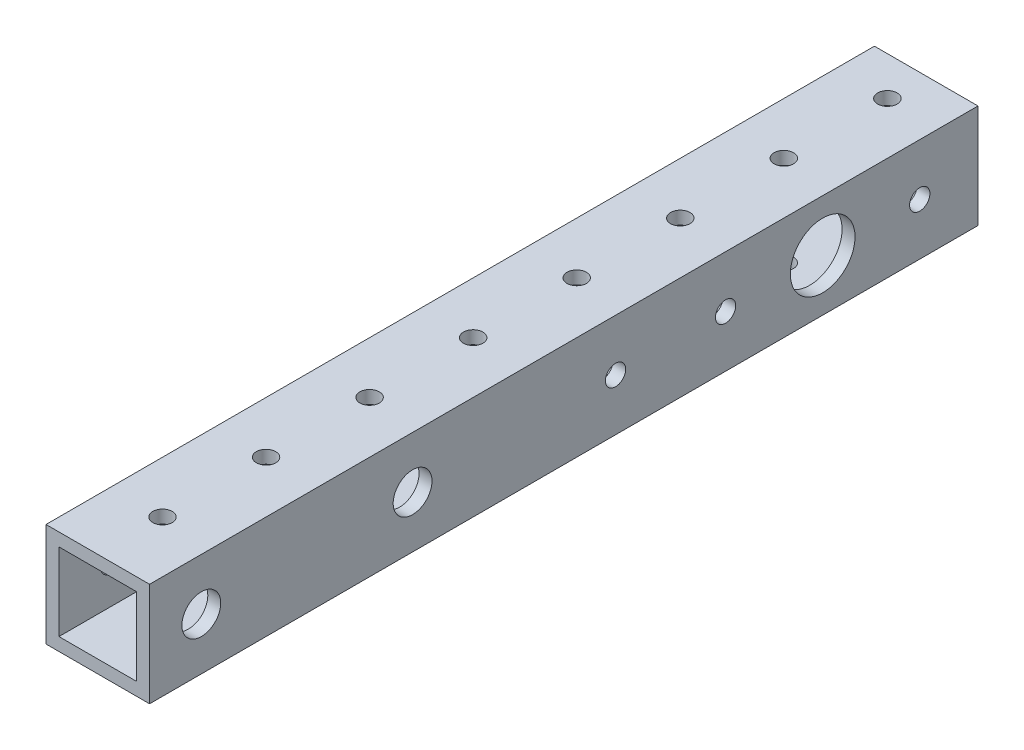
ISO-10303-21;
HEADER;
FILE_DESCRIPTION(('STEP AP214'),'2;1');
FILE_NAME('part.step','',(''),(''),'','','');
FILE_SCHEMA(('AUTOMOTIVE_DESIGN { 1 0 10303 214 1 1 1 1 }'));
ENDSEC;
DATA;
#1=APPLICATION_CONTEXT('core data for automotive mechanical design processes');
#2=APPLICATION_PROTOCOL_DEFINITION('international standard','automotive_design',2000,#1);
#3=PRODUCT_CONTEXT('',#1,'mechanical');
#4=PRODUCT('Part','Part','',(#3));
#5=PRODUCT_RELATED_PRODUCT_CATEGORY('part','',(#4));
#6=PRODUCT_DEFINITION_FORMATION('','',#4);
#7=PRODUCT_DEFINITION_CONTEXT('part definition',#1,'design');
#8=PRODUCT_DEFINITION('design','',#6,#7);
#9=PRODUCT_DEFINITION_SHAPE('','',#8);
#10=(LENGTH_UNIT() NAMED_UNIT(*) SI_UNIT(.MILLI.,.METRE.));
#11=(NAMED_UNIT(*) PLANE_ANGLE_UNIT() SI_UNIT($,.RADIAN.));
#12=(NAMED_UNIT(*) SI_UNIT($,.STERADIAN.) SOLID_ANGLE_UNIT());
#13=UNCERTAINTY_MEASURE_WITH_UNIT(LENGTH_MEASURE(1.E-05),#10,'distance_accuracy_value','');
#14=(GEOMETRIC_REPRESENTATION_CONTEXT(3) GLOBAL_UNCERTAINTY_ASSIGNED_CONTEXT((#13)) GLOBAL_UNIT_ASSIGNED_CONTEXT((#10,
#11,#12)) REPRESENTATION_CONTEXT('',''));
#15=CARTESIAN_POINT('',(0.,0.,0.));
#16=DIRECTION('',(0.,0.,1.));
#17=DIRECTION('',(1.,0.,0.));
#18=AXIS2_PLACEMENT_3D('',#15,#16,#17);
#19=CARTESIAN_POINT('',(12.7,-12.7,101.6));
#20=DIRECTION('',(-1.,0.,0.));
#21=DIRECTION('',(0.,0.,1.));
#22=AXIS2_PLACEMENT_3D('',#19,#20,#21);
#23=PLANE('',#22);
#24=DIRECTION('',(0.,1.,0.));
#25=VECTOR('',#24,1.);
#26=CARTESIAN_POINT('',(12.7,-12.7,-101.6));
#27=LINE('',#26,#25);
#28=CARTESIAN_POINT('',(12.7,-12.7,-101.6));
#29=VERTEX_POINT('',#28);
#30=CARTESIAN_POINT('',(12.7,12.7,-101.6));
#31=VERTEX_POINT('',#30);
#32=EDGE_CURVE('E116',#29,#31,#27,.T.);
#33=ORIENTED_EDGE('',*,*,#32,.T.);
#34=DIRECTION('',(0.,0.,-1.));
#35=VECTOR('',#34,1.);
#36=CARTESIAN_POINT('',(12.7,12.7,101.6));
#37=LINE('',#36,#35);
#38=CARTESIAN_POINT('',(12.7,12.7,101.6));
#39=VERTEX_POINT('',#38);
#40=EDGE_CURVE('E165',#39,#31,#37,.T.);
#41=ORIENTED_EDGE('',*,*,#40,.F.);
#42=DIRECTION('',(0.,1.,0.));
#43=VECTOR('',#42,1.);
#44=CARTESIAN_POINT('',(12.7,-12.7,101.6));
#45=LINE('',#44,#43);
#46=CARTESIAN_POINT('',(12.7,-12.7,101.6));
#47=VERTEX_POINT('',#46);
#48=EDGE_CURVE('E139',#47,#39,#45,.T.);
#49=ORIENTED_EDGE('',*,*,#48,.F.);
#50=DIRECTION('',(0.,0.,-1.));
#51=VECTOR('',#50,1.);
#52=CARTESIAN_POINT('',(12.7,-12.7,101.6));
#53=LINE('',#52,#51);
#54=EDGE_CURVE('E149',#47,#29,#53,.T.);
#55=ORIENTED_EDGE('',*,*,#54,.T.);
#56=EDGE_LOOP('',(#33,#41,#49,#55));
#57=FACE_BOUND('',#56,.T.);
#58=CARTESIAN_POINT('',(12.7,0.,-12.7));
#59=DIRECTION('',(1.,0.,0.));
#60=DIRECTION('',(0.,0.,-1.));
#61=AXIS2_PLACEMENT_3D('',#58,#59,#60);
#62=CIRCLE('',#61,2.4892);
#63=CARTESIAN_POINT('',(12.7,0.,-15.1892));
#64=VERTEX_POINT('',#63);
#65=EDGE_CURVE('E442',#64,#64,#62,.T.);
#66=ORIENTED_EDGE('',*,*,#65,.F.);
#67=EDGE_LOOP('',(#66));
#68=FACE_BOUND('',#67,.T.);
#69=CARTESIAN_POINT('',(12.7,0.,-39.6875));
#70=DIRECTION('',(1.,0.,0.));
#71=DIRECTION('',(0.,0.,-1.));
#72=AXIS2_PLACEMENT_3D('',#69,#70,#71);
#73=CIRCLE('',#72,2.4892);
#74=CARTESIAN_POINT('',(12.7,0.,-42.1767));
#75=VERTEX_POINT('',#74);
#76=EDGE_CURVE('E436',#75,#75,#73,.T.);
#77=ORIENTED_EDGE('',*,*,#76,.F.);
#78=EDGE_LOOP('',(#77));
#79=FACE_BOUND('',#78,.T.);
#80=CARTESIAN_POINT('',(12.7,0.,-87.3125));
#81=DIRECTION('',(1.,0.,0.));
#82=DIRECTION('',(0.,0.,-1.));
#83=AXIS2_PLACEMENT_3D('',#80,#81,#82);
#84=CIRCLE('',#83,2.4892);
#85=CARTESIAN_POINT('',(12.7,0.,-89.8017));
#86=VERTEX_POINT('',#85);
#87=EDGE_CURVE('E172',#86,#86,#84,.T.);
#88=ORIENTED_EDGE('',*,*,#87,.F.);
#89=EDGE_LOOP('',(#88));
#90=FACE_BOUND('',#89,.T.);
#91=CARTESIAN_POINT('',(12.7,0.,88.9));
#92=DIRECTION('',(1.,0.,0.));
#93=DIRECTION('',(0.,0.,-1.));
#94=AXIS2_PLACEMENT_3D('',#91,#92,#93);
#95=CIRCLE('',#94,4.7625);
#96=CARTESIAN_POINT('',(12.7,0.,84.1375));
#97=VERTEX_POINT('',#96);
#98=EDGE_CURVE('E480',#97,#97,#95,.T.);
#99=ORIENTED_EDGE('',*,*,#98,.F.);
#100=EDGE_LOOP('',(#99));
#101=FACE_BOUND('',#100,.T.);
#102=CARTESIAN_POINT('',(12.7,0.,37.084));
#103=DIRECTION('',(1.,0.,0.));
#104=DIRECTION('',(0.,0.,-1.));
#105=AXIS2_PLACEMENT_3D('',#102,#103,#104);
#106=CIRCLE('',#105,4.7625);
#107=CARTESIAN_POINT('',(12.7,0.,32.3215));
#108=VERTEX_POINT('',#107);
#109=EDGE_CURVE('E476',#108,#108,#106,.T.);
#110=ORIENTED_EDGE('',*,*,#109,.F.);
#111=EDGE_LOOP('',(#110));
#112=FACE_BOUND('',#111,.T.);
#113=CARTESIAN_POINT('',(12.7,0.,-63.5));
#114=DIRECTION('',(-1.,0.,0.));
#115=DIRECTION('',(0.,0.,1.));
#116=AXIS2_PLACEMENT_3D('',#113,#114,#115);
#117=CIRCLE('',#116,7.9375);
#118=CARTESIAN_POINT('',(12.7,0.,-71.4375));
#119=VERTEX_POINT('',#118);
#120=EDGE_CURVE('E465',#119,#119,#117,.T.);
#121=ORIENTED_EDGE('',*,*,#120,.T.);
#122=EDGE_LOOP('',(#121));
#123=FACE_BOUND('',#122,.T.);
#124=ADVANCED_FACE('F33',(#57,#68,#79,#90,#101,#112,#123),#23,.F.);
#125=CARTESIAN_POINT('',(9.525,-9.525,101.6));
#126=DIRECTION('',(-1.,0.,0.));
#127=DIRECTION('',(0.,0.,1.));
#128=AXIS2_PLACEMENT_3D('',#125,#126,#127);
#129=PLANE('',#128);
#130=DIRECTION('',(0.,1.,0.));
#131=VECTOR('',#130,1.);
#132=CARTESIAN_POINT('',(9.525,-9.525,-101.6));
#133=LINE('',#132,#131);
#134=CARTESIAN_POINT('',(9.525,-9.525,-101.6));
#135=VERTEX_POINT('',#134);
#136=CARTESIAN_POINT('',(9.525,9.525,-101.6));
#137=VERTEX_POINT('',#136);
#138=EDGE_CURVE('E56',#135,#137,#133,.T.);
#139=ORIENTED_EDGE('',*,*,#138,.F.);
#140=DIRECTION('',(0.,0.,-1.));
#141=VECTOR('',#140,1.);
#142=CARTESIAN_POINT('',(9.525,-9.525,101.6));
#143=LINE('',#142,#141);
#144=CARTESIAN_POINT('',(9.525,-9.525,101.6));
#145=VERTEX_POINT('',#144);
#146=EDGE_CURVE('E103',#145,#135,#143,.T.);
#147=ORIENTED_EDGE('',*,*,#146,.F.);
#148=DIRECTION('',(0.,1.,0.));
#149=VECTOR('',#148,1.);
#150=CARTESIAN_POINT('',(9.525,-9.525,101.6));
#151=LINE('',#150,#149);
#152=CARTESIAN_POINT('',(9.525,9.525,101.6));
#153=VERTEX_POINT('',#152);
#154=EDGE_CURVE('E98',#145,#153,#151,.T.);
#155=ORIENTED_EDGE('',*,*,#154,.T.);
#156=DIRECTION('',(0.,0.,-1.));
#157=VECTOR('',#156,1.);
#158=CARTESIAN_POINT('',(9.525,9.525,101.6));
#159=LINE('',#158,#157);
#160=EDGE_CURVE('E102',#153,#137,#159,.T.);
#161=ORIENTED_EDGE('',*,*,#160,.T.);
#162=EDGE_LOOP('',(#139,#147,#155,#161));
#163=FACE_BOUND('',#162,.T.);
#164=CARTESIAN_POINT('',(9.525,0.,-12.7));
#165=DIRECTION('',(-1.,0.,0.));
#166=DIRECTION('',(0.,0.,1.));
#167=AXIS2_PLACEMENT_3D('',#164,#165,#166);
#168=CIRCLE('',#167,2.4892);
#169=CARTESIAN_POINT('',(9.525,0.,-10.2108));
#170=VERTEX_POINT('',#169);
#171=EDGE_CURVE('E129',#170,#170,#168,.T.);
#172=ORIENTED_EDGE('',*,*,#171,.F.);
#173=EDGE_LOOP('',(#172));
#174=FACE_BOUND('',#173,.T.);
#175=CARTESIAN_POINT('',(9.525,0.,-39.6875));
#176=DIRECTION('',(-1.,0.,0.));
#177=DIRECTION('',(0.,0.,1.));
#178=AXIS2_PLACEMENT_3D('',#175,#176,#177);
#179=CIRCLE('',#178,2.4892);
#180=CARTESIAN_POINT('',(9.525,0.,-37.1983));
#181=VERTEX_POINT('',#180);
#182=EDGE_CURVE('E439',#181,#181,#179,.T.);
#183=ORIENTED_EDGE('',*,*,#182,.F.);
#184=EDGE_LOOP('',(#183));
#185=FACE_BOUND('',#184,.T.);
#186=CARTESIAN_POINT('',(9.525,0.,-87.3125));
#187=DIRECTION('',(-1.,0.,0.));
#188=DIRECTION('',(0.,0.,1.));
#189=AXIS2_PLACEMENT_3D('',#186,#187,#188);
#190=CIRCLE('',#189,2.4892);
#191=CARTESIAN_POINT('',(9.525,0.,-84.8233));
#192=VERTEX_POINT('',#191);
#193=EDGE_CURVE('E433',#192,#192,#190,.T.);
#194=ORIENTED_EDGE('',*,*,#193,.F.);
#195=EDGE_LOOP('',(#194));
#196=FACE_BOUND('',#195,.T.);
#197=CARTESIAN_POINT('',(9.525,0.,88.9));
#198=DIRECTION('',(-1.,0.,0.));
#199=DIRECTION('',(0.,0.,1.));
#200=AXIS2_PLACEMENT_3D('',#197,#198,#199);
#201=CIRCLE('',#200,4.7625);
#202=CARTESIAN_POINT('',(9.525,0.,84.1375));
#203=VERTEX_POINT('',#202);
#204=EDGE_CURVE('E455',#203,#203,#201,.F.);
#205=ORIENTED_EDGE('',*,*,#204,.T.);
#206=EDGE_LOOP('',(#205));
#207=FACE_BOUND('',#206,.T.);
#208=CARTESIAN_POINT('',(9.525,0.,37.084));
#209=DIRECTION('',(-1.,0.,0.));
#210=DIRECTION('',(0.,0.,1.));
#211=AXIS2_PLACEMENT_3D('',#208,#209,#210);
#212=CIRCLE('',#211,4.7625);
#213=CARTESIAN_POINT('',(9.525,0.,32.3215));
#214=VERTEX_POINT('',#213);
#215=EDGE_CURVE('E459',#214,#214,#212,.F.);
#216=ORIENTED_EDGE('',*,*,#215,.T.);
#217=EDGE_LOOP('',(#216));
#218=FACE_BOUND('',#217,.T.);
#219=CARTESIAN_POINT('',(9.525,0.,-63.5));
#220=DIRECTION('',(-1.,0.,0.));
#221=DIRECTION('',(0.,0.,1.));
#222=AXIS2_PLACEMENT_3D('',#219,#220,#221);
#223=CIRCLE('',#222,7.9375);
#224=CARTESIAN_POINT('',(9.525,0.,-71.4375));
#225=VERTEX_POINT('',#224);
#226=EDGE_CURVE('E462',#225,#225,#223,.T.);
#227=ORIENTED_EDGE('',*,*,#226,.F.);
#228=EDGE_LOOP('',(#227));
#229=FACE_BOUND('',#228,.T.);
#230=ADVANCED_FACE('F100',(#163,#174,#185,#196,#207,#218,#229),#129,.T.);
#231=CARTESIAN_POINT('',(0.,0.,101.6));
#232=DIRECTION('',(0.,0.,-1.));
#233=DIRECTION('',(-1.,0.,0.));
#234=AXIS2_PLACEMENT_3D('',#231,#232,#233);
#235=PLANE('',#234);
#236=ORIENTED_EDGE('',*,*,#48,.T.);
#237=DIRECTION('',(-1.,0.,0.));
#238=VECTOR('',#237,1.);
#239=CARTESIAN_POINT('',(-12.7,12.7,101.6));
#240=LINE('',#239,#238);
#241=CARTESIAN_POINT('',(-12.7,12.7,101.6));
#242=VERTEX_POINT('',#241);
#243=EDGE_CURVE('E142',#39,#242,#240,.T.);
#244=ORIENTED_EDGE('',*,*,#243,.T.);
#245=DIRECTION('',(0.,-1.,0.));
#246=VECTOR('',#245,1.);
#247=CARTESIAN_POINT('',(-12.7,-12.7,101.6));
#248=LINE('',#247,#246);
#249=CARTESIAN_POINT('',(-12.7,-12.7,101.6));
#250=VERTEX_POINT('',#249);
#251=EDGE_CURVE('E145',#242,#250,#248,.T.);
#252=ORIENTED_EDGE('',*,*,#251,.T.);
#253=DIRECTION('',(1.,0.,0.));
#254=VECTOR('',#253,1.);
#255=CARTESIAN_POINT('',(-12.7,-12.7,101.6));
#256=LINE('',#255,#254);
#257=EDGE_CURVE('E147',#250,#47,#256,.T.);
#258=ORIENTED_EDGE('',*,*,#257,.T.);
#259=EDGE_LOOP('',(#236,#244,#252,#258));
#260=FACE_BOUND('',#259,.T.);
#261=ORIENTED_EDGE('',*,*,#154,.F.);
#262=DIRECTION('',(1.,0.,0.));
#263=VECTOR('',#262,1.);
#264=CARTESIAN_POINT('',(-9.525,-9.525,101.6));
#265=LINE('',#264,#263);
#266=CARTESIAN_POINT('',(-9.525,-9.525,101.6));
#267=VERTEX_POINT('',#266);
#268=EDGE_CURVE('E123',#267,#145,#265,.T.);
#269=ORIENTED_EDGE('',*,*,#268,.F.);
#270=DIRECTION('',(0.,-1.,0.));
#271=VECTOR('',#270,1.);
#272=CARTESIAN_POINT('',(-9.525,-9.525,101.6));
#273=LINE('',#272,#271);
#274=CARTESIAN_POINT('',(-9.525,9.525,101.6));
#275=VERTEX_POINT('',#274);
#276=EDGE_CURVE('E121',#275,#267,#273,.T.);
#277=ORIENTED_EDGE('',*,*,#276,.F.);
#278=DIRECTION('',(-1.,0.,0.));
#279=VECTOR('',#278,1.);
#280=CARTESIAN_POINT('',(-9.525,9.525,101.6));
#281=LINE('',#280,#279);
#282=EDGE_CURVE('E107',#153,#275,#281,.T.);
#283=ORIENTED_EDGE('',*,*,#282,.F.);
#284=EDGE_LOOP('',(#261,#269,#277,#283));
#285=FACE_BOUND('',#284,.T.);
#286=ADVANCED_FACE('F120',(#260,#285),#235,.F.);
#287=CARTESIAN_POINT('',(0.,0.,-101.6));
#288=DIRECTION('',(0.,0.,-1.));
#289=DIRECTION('',(-1.,0.,0.));
#290=AXIS2_PLACEMENT_3D('',#287,#288,#289);
#291=PLANE('',#290);
#292=ORIENTED_EDGE('',*,*,#32,.F.);
#293=DIRECTION('',(1.,0.,0.));
#294=VECTOR('',#293,1.);
#295=CARTESIAN_POINT('',(-12.7,-12.7,-101.6));
#296=LINE('',#295,#294);
#297=CARTESIAN_POINT('',(-12.7,-12.7,-101.6));
#298=VERTEX_POINT('',#297);
#299=EDGE_CURVE('E143',#298,#29,#296,.T.);
#300=ORIENTED_EDGE('',*,*,#299,.F.);
#301=DIRECTION('',(0.,-1.,0.));
#302=VECTOR('',#301,1.);
#303=CARTESIAN_POINT('',(-12.7,-12.7,-101.6));
#304=LINE('',#303,#302);
#305=CARTESIAN_POINT('',(-12.7,12.7,-101.6));
#306=VERTEX_POINT('',#305);
#307=EDGE_CURVE('E154',#306,#298,#304,.T.);
#308=ORIENTED_EDGE('',*,*,#307,.F.);
#309=DIRECTION('',(-1.,0.,0.));
#310=VECTOR('',#309,1.);
#311=CARTESIAN_POINT('',(-12.7,12.7,-101.6));
#312=LINE('',#311,#310);
#313=EDGE_CURVE('E152',#31,#306,#312,.T.);
#314=ORIENTED_EDGE('',*,*,#313,.F.);
#315=EDGE_LOOP('',(#292,#300,#308,#314));
#316=FACE_BOUND('',#315,.T.);
#317=DIRECTION('',(1.,0.,0.));
#318=VECTOR('',#317,1.);
#319=CARTESIAN_POINT('',(-9.525,-9.525,-101.6));
#320=LINE('',#319,#318);
#321=CARTESIAN_POINT('',(-9.525,-9.525,-101.6));
#322=VERTEX_POINT('',#321);
#323=EDGE_CURVE('E108',#322,#135,#320,.T.);
#324=ORIENTED_EDGE('',*,*,#323,.T.);
#325=ORIENTED_EDGE('',*,*,#138,.T.);
#326=DIRECTION('',(-1.,0.,0.));
#327=VECTOR('',#326,1.);
#328=CARTESIAN_POINT('',(-9.525,9.525,-101.6));
#329=LINE('',#328,#327);
#330=CARTESIAN_POINT('',(-9.525,9.525,-101.6));
#331=VERTEX_POINT('',#330);
#332=EDGE_CURVE('E115',#137,#331,#329,.T.);
#333=ORIENTED_EDGE('',*,*,#332,.T.);
#334=DIRECTION('',(0.,-1.,0.));
#335=VECTOR('',#334,1.);
#336=CARTESIAN_POINT('',(-9.525,-9.525,-101.6));
#337=LINE('',#336,#335);
#338=EDGE_CURVE('E131',#331,#322,#337,.T.);
#339=ORIENTED_EDGE('',*,*,#338,.T.);
#340=EDGE_LOOP('',(#324,#325,#333,#339));
#341=FACE_BOUND('',#340,.T.);
#342=ADVANCED_FACE('F346',(#316,#341),#291,.T.);
#343=CARTESIAN_POINT('',(-12.7,12.7,101.6));
#344=DIRECTION('',(0.,-1.,0.));
#345=DIRECTION('',(0.,0.,-1.));
#346=AXIS2_PLACEMENT_3D('',#343,#344,#345);
#347=PLANE('',#346);
#348=CARTESIAN_POINT('',(0.,12.7,-66.675));
#349=DIRECTION('',(0.,1.,0.));
#350=DIRECTION('',(0.,0.,1.));
#351=AXIS2_PLACEMENT_3D('',#348,#349,#350);
#352=CIRCLE('',#351,2.38125);
#353=CARTESIAN_POINT('',(0.,12.7,-64.29375));
#354=VERTEX_POINT('',#353);
#355=EDGE_CURVE('E416',#354,#354,#352,.T.);
#356=ORIENTED_EDGE('',*,*,#355,.F.);
#357=EDGE_LOOP('',(#356));
#358=FACE_BOUND('',#357,.T.);
#359=CARTESIAN_POINT('',(0.,12.7,-92.075));
#360=DIRECTION('',(0.,1.,0.));
#361=DIRECTION('',(0.,0.,1.));
#362=AXIS2_PLACEMENT_3D('',#359,#360,#361);
#363=CIRCLE('',#362,2.38125);
#364=CARTESIAN_POINT('',(0.,12.7,-89.69375));
#365=VERTEX_POINT('',#364);
#366=EDGE_CURVE('E419',#365,#365,#363,.T.);
#367=ORIENTED_EDGE('',*,*,#366,.F.);
#368=EDGE_LOOP('',(#367));
#369=FACE_BOUND('',#368,.T.);
#370=ORIENTED_EDGE('',*,*,#313,.T.);
#371=DIRECTION('',(0.,0.,-1.));
#372=VECTOR('',#371,1.);
#373=CARTESIAN_POINT('',(-12.7,12.7,101.6));
#374=LINE('',#373,#372);
#375=EDGE_CURVE('E162',#242,#306,#374,.T.);
#376=ORIENTED_EDGE('',*,*,#375,.F.);
#377=ORIENTED_EDGE('',*,*,#243,.F.);
#378=ORIENTED_EDGE('',*,*,#40,.T.);
#379=EDGE_LOOP('',(#370,#376,#377,#378));
#380=FACE_BOUND('',#379,.T.);
#381=CARTESIAN_POINT('',(0.,12.7,-41.275));
#382=DIRECTION('',(0.,1.,0.));
#383=DIRECTION('',(0.,0.,1.));
#384=AXIS2_PLACEMENT_3D('',#381,#382,#383);
#385=CIRCLE('',#384,2.38125);
#386=CARTESIAN_POINT('',(0.,12.7,-38.89375));
#387=VERTEX_POINT('',#386);
#388=EDGE_CURVE('E181',#387,#387,#385,.T.);
#389=ORIENTED_EDGE('',*,*,#388,.F.);
#390=EDGE_LOOP('',(#389));
#391=FACE_BOUND('',#390,.T.);
#392=CARTESIAN_POINT('',(0.,12.7,-15.875));
#393=DIRECTION('',(0.,1.,0.));
#394=DIRECTION('',(0.,0.,1.));
#395=AXIS2_PLACEMENT_3D('',#392,#393,#394);
#396=CIRCLE('',#395,2.38125);
#397=CARTESIAN_POINT('',(0.,12.7,-13.49375));
#398=VERTEX_POINT('',#397);
#399=EDGE_CURVE('E187',#398,#398,#396,.T.);
#400=ORIENTED_EDGE('',*,*,#399,.F.);
#401=EDGE_LOOP('',(#400));
#402=FACE_BOUND('',#401,.T.);
#403=CARTESIAN_POINT('',(0.,12.7,9.52500000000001));
#404=DIRECTION('',(0.,1.,0.));
#405=DIRECTION('',(0.,0.,1.));
#406=AXIS2_PLACEMENT_3D('',#403,#404,#405);
#407=CIRCLE('',#406,2.38125);
#408=CARTESIAN_POINT('',(0.,12.7,11.90625));
#409=VERTEX_POINT('',#408);
#410=EDGE_CURVE('E193',#409,#409,#407,.T.);
#411=ORIENTED_EDGE('',*,*,#410,.F.);
#412=EDGE_LOOP('',(#411));
#413=FACE_BOUND('',#412,.T.);
#414=CARTESIAN_POINT('',(0.,12.7,34.925));
#415=DIRECTION('',(0.,1.,0.));
#416=DIRECTION('',(0.,0.,1.));
#417=AXIS2_PLACEMENT_3D('',#414,#415,#416);
#418=CIRCLE('',#417,2.38125);
#419=CARTESIAN_POINT('',(0.,12.7,37.30625));
#420=VERTEX_POINT('',#419);
#421=EDGE_CURVE('E199',#420,#420,#418,.T.);
#422=ORIENTED_EDGE('',*,*,#421,.F.);
#423=EDGE_LOOP('',(#422));
#424=FACE_BOUND('',#423,.T.);
#425=CARTESIAN_POINT('',(0.,12.7,60.325));
#426=DIRECTION('',(0.,1.,0.));
#427=DIRECTION('',(0.,0.,1.));
#428=AXIS2_PLACEMENT_3D('',#425,#426,#427);
#429=CIRCLE('',#428,2.38125);
#430=CARTESIAN_POINT('',(0.,12.7,62.70625));
#431=VERTEX_POINT('',#430);
#432=EDGE_CURVE('E205',#431,#431,#429,.T.);
#433=ORIENTED_EDGE('',*,*,#432,.F.);
#434=EDGE_LOOP('',(#433));
#435=FACE_BOUND('',#434,.T.);
#436=CARTESIAN_POINT('',(0.,12.7,85.725));
#437=DIRECTION('',(0.,1.,0.));
#438=DIRECTION('',(0.,0.,1.));
#439=AXIS2_PLACEMENT_3D('',#436,#437,#438);
#440=CIRCLE('',#439,2.38125);
#441=CARTESIAN_POINT('',(0.,12.7,88.10625));
#442=VERTEX_POINT('',#441);
#443=EDGE_CURVE('E211',#442,#442,#440,.T.);
#444=ORIENTED_EDGE('',*,*,#443,.F.);
#445=EDGE_LOOP('',(#444));
#446=FACE_BOUND('',#445,.T.);
#447=ADVANCED_FACE('F275',(#358,#369,#380,#391,#402,#413,#424,#435,#446),#347,.F.);
#448=CARTESIAN_POINT('',(-12.7,-12.7,101.6));
#449=DIRECTION('',(1.,0.,0.));
#450=DIRECTION('',(0.,0.,-1.));
#451=AXIS2_PLACEMENT_3D('',#448,#449,#450);
#452=PLANE('',#451);
#453=CARTESIAN_POINT('',(-12.7,0.,-12.7));
#454=DIRECTION('',(1.,0.,0.));
#455=DIRECTION('',(0.,0.,-1.));
#456=AXIS2_PLACEMENT_3D('',#453,#454,#455);
#457=CIRCLE('',#456,4.7625);
#458=CARTESIAN_POINT('',(-12.7,0.,-17.4625));
#459=VERTEX_POINT('',#458);
#460=EDGE_CURVE('E468',#459,#459,#457,.F.);
#461=ORIENTED_EDGE('',*,*,#460,.F.);
#462=EDGE_LOOP('',(#461));
#463=FACE_BOUND('',#462,.T.);
#464=CARTESIAN_POINT('',(-12.7,0.,88.9));
#465=DIRECTION('',(-1.,0.,0.));
#466=DIRECTION('',(0.,0.,1.));
#467=AXIS2_PLACEMENT_3D('',#464,#465,#466);
#468=CIRCLE('',#467,2.4892);
#469=CARTESIAN_POINT('',(-12.7,0.,91.3892));
#470=VERTEX_POINT('',#469);
#471=EDGE_CURVE('E484',#470,#470,#468,.T.);
#472=ORIENTED_EDGE('',*,*,#471,.F.);
#473=EDGE_LOOP('',(#472));
#474=FACE_BOUND('',#473,.T.);
#475=CARTESIAN_POINT('',(-12.7,0.,37.084));
#476=DIRECTION('',(-1.,0.,0.));
#477=DIRECTION('',(0.,0.,1.));
#478=AXIS2_PLACEMENT_3D('',#475,#476,#477);
#479=CIRCLE('',#478,2.4892);
#480=CARTESIAN_POINT('',(-12.7,0.,39.5732));
#481=VERTEX_POINT('',#480);
#482=EDGE_CURVE('E490',#481,#481,#479,.T.);
#483=ORIENTED_EDGE('',*,*,#482,.F.);
#484=EDGE_LOOP('',(#483));
#485=FACE_BOUND('',#484,.T.);
#486=CARTESIAN_POINT('',(-12.7,0.,-39.6875));
#487=DIRECTION('',(-1.,0.,0.));
#488=DIRECTION('',(0.,0.,1.));
#489=AXIS2_PLACEMENT_3D('',#486,#487,#488);
#490=CIRCLE('',#489,4.7625);
#491=CARTESIAN_POINT('',(-12.7,0.,-34.925));
#492=VERTEX_POINT('',#491);
#493=EDGE_CURVE('E496',#492,#492,#490,.T.);
#494=ORIENTED_EDGE('',*,*,#493,.F.);
#495=EDGE_LOOP('',(#494));
#496=FACE_BOUND('',#495,.T.);
#497=CARTESIAN_POINT('',(-12.7,0.,-87.3125));
#498=DIRECTION('',(-1.,0.,0.));
#499=DIRECTION('',(0.,0.,1.));
#500=AXIS2_PLACEMENT_3D('',#497,#498,#499);
#501=CIRCLE('',#500,4.7625);
#502=CARTESIAN_POINT('',(-12.7,0.,-82.55));
#503=VERTEX_POINT('',#502);
#504=EDGE_CURVE('E502',#503,#503,#501,.T.);
#505=ORIENTED_EDGE('',*,*,#504,.F.);
#506=EDGE_LOOP('',(#505));
#507=FACE_BOUND('',#506,.T.);
#508=CARTESIAN_POINT('',(-12.7,0.,-63.5));
#509=DIRECTION('',(1.,0.,0.));
#510=DIRECTION('',(0.,0.,-1.));
#511=AXIS2_PLACEMENT_3D('',#508,#509,#510);
#512=CIRCLE('',#511,2.43840000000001);
#513=CARTESIAN_POINT('',(-12.7,0.,-65.9384));
#514=VERTEX_POINT('',#513);
#515=EDGE_CURVE('E173',#514,#514,#512,.T.);
#516=ORIENTED_EDGE('',*,*,#515,.T.);
#517=EDGE_LOOP('',(#516));
#518=FACE_BOUND('',#517,.T.);
#519=ORIENTED_EDGE('',*,*,#307,.T.);
#520=DIRECTION('',(0.,0.,-1.));
#521=VECTOR('',#520,1.);
#522=CARTESIAN_POINT('',(-12.7,-12.7,101.6));
#523=LINE('',#522,#521);
#524=EDGE_CURVE('E159',#250,#298,#523,.T.);
#525=ORIENTED_EDGE('',*,*,#524,.F.);
#526=ORIENTED_EDGE('',*,*,#251,.F.);
#527=ORIENTED_EDGE('',*,*,#375,.T.);
#528=EDGE_LOOP('',(#519,#525,#526,#527));
#529=FACE_BOUND('',#528,.T.);
#530=ADVANCED_FACE('F332',(#463,#474,#485,#496,#507,#518,#529),#452,.F.);
#531=CARTESIAN_POINT('',(-12.7,-12.7,101.6));
#532=DIRECTION('',(0.,1.,0.));
#533=DIRECTION('',(0.,0.,1.));
#534=AXIS2_PLACEMENT_3D('',#531,#532,#533);
#535=PLANE('',#534);
#536=CARTESIAN_POINT('',(0.,-12.7,-66.675));
#537=DIRECTION('',(0.,1.,0.));
#538=DIRECTION('',(0.,0.,1.));
#539=AXIS2_PLACEMENT_3D('',#536,#537,#538);
#540=CIRCLE('',#539,2.38125);
#541=CARTESIAN_POINT('',(0.,-12.7,-64.29375));
#542=VERTEX_POINT('',#541);
#543=EDGE_CURVE('E510',#542,#542,#540,.T.);
#544=ORIENTED_EDGE('',*,*,#543,.T.);
#545=EDGE_LOOP('',(#544));
#546=FACE_BOUND('',#545,.T.);
#547=CARTESIAN_POINT('',(0.,-12.7,-92.075));
#548=DIRECTION('',(0.,1.,0.));
#549=DIRECTION('',(0.,0.,1.));
#550=AXIS2_PLACEMENT_3D('',#547,#548,#549);
#551=CIRCLE('',#550,2.38125);
#552=CARTESIAN_POINT('',(0.,-12.7,-89.69375));
#553=VERTEX_POINT('',#552);
#554=EDGE_CURVE('E178',#553,#553,#551,.T.);
#555=ORIENTED_EDGE('',*,*,#554,.T.);
#556=EDGE_LOOP('',(#555));
#557=FACE_BOUND('',#556,.T.);
#558=ORIENTED_EDGE('',*,*,#299,.T.);
#559=ORIENTED_EDGE('',*,*,#54,.F.);
#560=ORIENTED_EDGE('',*,*,#257,.F.);
#561=ORIENTED_EDGE('',*,*,#524,.T.);
#562=EDGE_LOOP('',(#558,#559,#560,#561));
#563=FACE_BOUND('',#562,.T.);
#564=CARTESIAN_POINT('',(0.,-12.7,-41.275));
#565=DIRECTION('',(0.,1.,0.));
#566=DIRECTION('',(0.,0.,1.));
#567=AXIS2_PLACEMENT_3D('',#564,#565,#566);
#568=CIRCLE('',#567,2.38125);
#569=CARTESIAN_POINT('',(0.,-12.7,-38.89375));
#570=VERTEX_POINT('',#569);
#571=EDGE_CURVE('E217',#570,#570,#568,.T.);
#572=ORIENTED_EDGE('',*,*,#571,.T.);
#573=EDGE_LOOP('',(#572));
#574=FACE_BOUND('',#573,.T.);
#575=CARTESIAN_POINT('',(0.,-12.7,-15.875));
#576=DIRECTION('',(0.,1.,0.));
#577=DIRECTION('',(0.,0.,1.));
#578=AXIS2_PLACEMENT_3D('',#575,#576,#577);
#579=CIRCLE('',#578,2.38125);
#580=CARTESIAN_POINT('',(0.,-12.7,-13.49375));
#581=VERTEX_POINT('',#580);
#582=EDGE_CURVE('E223',#581,#581,#579,.T.);
#583=ORIENTED_EDGE('',*,*,#582,.T.);
#584=EDGE_LOOP('',(#583));
#585=FACE_BOUND('',#584,.T.);
#586=CARTESIAN_POINT('',(0.,-12.7,9.52500000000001));
#587=DIRECTION('',(0.,1.,0.));
#588=DIRECTION('',(0.,0.,1.));
#589=AXIS2_PLACEMENT_3D('',#586,#587,#588);
#590=CIRCLE('',#589,2.38125);
#591=CARTESIAN_POINT('',(0.,-12.7,11.90625));
#592=VERTEX_POINT('',#591);
#593=EDGE_CURVE('E229',#592,#592,#590,.T.);
#594=ORIENTED_EDGE('',*,*,#593,.T.);
#595=EDGE_LOOP('',(#594));
#596=FACE_BOUND('',#595,.T.);
#597=CARTESIAN_POINT('',(0.,-12.7,34.925));
#598=DIRECTION('',(0.,1.,0.));
#599=DIRECTION('',(0.,0.,1.));
#600=AXIS2_PLACEMENT_3D('',#597,#598,#599);
#601=CIRCLE('',#600,2.38125);
#602=CARTESIAN_POINT('',(0.,-12.7,37.30625));
#603=VERTEX_POINT('',#602);
#604=EDGE_CURVE('E235',#603,#603,#601,.T.);
#605=ORIENTED_EDGE('',*,*,#604,.T.);
#606=EDGE_LOOP('',(#605));
#607=FACE_BOUND('',#606,.T.);
#608=CARTESIAN_POINT('',(0.,-12.7,60.325));
#609=DIRECTION('',(0.,1.,0.));
#610=DIRECTION('',(0.,0.,1.));
#611=AXIS2_PLACEMENT_3D('',#608,#609,#610);
#612=CIRCLE('',#611,2.38125);
#613=CARTESIAN_POINT('',(0.,-12.7,62.70625));
#614=VERTEX_POINT('',#613);
#615=EDGE_CURVE('E241',#614,#614,#612,.T.);
#616=ORIENTED_EDGE('',*,*,#615,.T.);
#617=EDGE_LOOP('',(#616));
#618=FACE_BOUND('',#617,.T.);
#619=CARTESIAN_POINT('',(0.,-12.7,85.725));
#620=DIRECTION('',(0.,1.,0.));
#621=DIRECTION('',(0.,0.,1.));
#622=AXIS2_PLACEMENT_3D('',#619,#620,#621);
#623=CIRCLE('',#622,2.38125);
#624=CARTESIAN_POINT('',(0.,-12.7,88.10625));
#625=VERTEX_POINT('',#624);
#626=EDGE_CURVE('E11',#625,#625,#623,.T.);
#627=ORIENTED_EDGE('',*,*,#626,.T.);
#628=EDGE_LOOP('',(#627));
#629=FACE_BOUND('',#628,.T.);
#630=ADVANCED_FACE('F329',(#546,#557,#563,#574,#585,#596,#607,#618,#629),#535,.F.);
#631=CARTESIAN_POINT('',(-9.525,9.525,101.6));
#632=DIRECTION('',(0.,-1.,0.));
#633=DIRECTION('',(0.,0.,-1.));
#634=AXIS2_PLACEMENT_3D('',#631,#632,#633);
#635=PLANE('',#634);
#636=CARTESIAN_POINT('',(0.,9.525,-66.675));
#637=DIRECTION('',(0.,-1.,0.));
#638=DIRECTION('',(0.,0.,-1.));
#639=AXIS2_PLACEMENT_3D('',#636,#637,#638);
#640=CIRCLE('',#639,2.38125);
#641=CARTESIAN_POINT('',(0.,9.525,-69.05625));
#642=VERTEX_POINT('',#641);
#643=EDGE_CURVE('E424',#642,#642,#640,.T.);
#644=ORIENTED_EDGE('',*,*,#643,.F.);
#645=EDGE_LOOP('',(#644));
#646=FACE_BOUND('',#645,.T.);
#647=CARTESIAN_POINT('',(0.,9.525,-92.075));
#648=DIRECTION('',(0.,-1.,0.));
#649=DIRECTION('',(0.,0.,-1.));
#650=AXIS2_PLACEMENT_3D('',#647,#648,#649);
#651=CIRCLE('',#650,2.38125);
#652=CARTESIAN_POINT('',(0.,9.525,-94.45625));
#653=VERTEX_POINT('',#652);
#654=EDGE_CURVE('E177',#653,#653,#651,.T.);
#655=ORIENTED_EDGE('',*,*,#654,.F.);
#656=EDGE_LOOP('',(#655));
#657=FACE_BOUND('',#656,.T.);
#658=ORIENTED_EDGE('',*,*,#332,.F.);
#659=ORIENTED_EDGE('',*,*,#160,.F.);
#660=ORIENTED_EDGE('',*,*,#282,.T.);
#661=DIRECTION('',(0.,0.,-1.));
#662=VECTOR('',#661,1.);
#663=CARTESIAN_POINT('',(-9.525,9.525,101.6));
#664=LINE('',#663,#662);
#665=EDGE_CURVE('E117',#275,#331,#664,.T.);
#666=ORIENTED_EDGE('',*,*,#665,.T.);
#667=EDGE_LOOP('',(#658,#659,#660,#666));
#668=FACE_BOUND('',#667,.T.);
#669=CARTESIAN_POINT('',(0.,9.525,-41.275));
#670=DIRECTION('',(0.,-1.,0.));
#671=DIRECTION('',(0.,0.,-1.));
#672=AXIS2_PLACEMENT_3D('',#669,#670,#671);
#673=CIRCLE('',#672,2.38125);
#674=CARTESIAN_POINT('',(0.,9.525,-43.65625));
#675=VERTEX_POINT('',#674);
#676=EDGE_CURVE('E168',#675,#675,#673,.T.);
#677=ORIENTED_EDGE('',*,*,#676,.F.);
#678=EDGE_LOOP('',(#677));
#679=FACE_BOUND('',#678,.T.);
#680=CARTESIAN_POINT('',(0.,9.525,-15.875));
#681=DIRECTION('',(0.,-1.,0.));
#682=DIRECTION('',(0.,0.,-1.));
#683=AXIS2_PLACEMENT_3D('',#680,#681,#682);
#684=CIRCLE('',#683,2.38125);
#685=CARTESIAN_POINT('',(0.,9.525,-18.25625));
#686=VERTEX_POINT('',#685);
#687=EDGE_CURVE('E184',#686,#686,#684,.T.);
#688=ORIENTED_EDGE('',*,*,#687,.F.);
#689=EDGE_LOOP('',(#688));
#690=FACE_BOUND('',#689,.T.);
#691=CARTESIAN_POINT('',(0.,9.525,9.52500000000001));
#692=DIRECTION('',(0.,-1.,0.));
#693=DIRECTION('',(0.,0.,-1.));
#694=AXIS2_PLACEMENT_3D('',#691,#692,#693);
#695=CIRCLE('',#694,2.38125);
#696=CARTESIAN_POINT('',(0.,9.525,7.14375000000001));
#697=VERTEX_POINT('',#696);
#698=EDGE_CURVE('E190',#697,#697,#695,.T.);
#699=ORIENTED_EDGE('',*,*,#698,.F.);
#700=EDGE_LOOP('',(#699));
#701=FACE_BOUND('',#700,.T.);
#702=CARTESIAN_POINT('',(0.,9.525,34.925));
#703=DIRECTION('',(0.,-1.,0.));
#704=DIRECTION('',(0.,0.,-1.));
#705=AXIS2_PLACEMENT_3D('',#702,#703,#704);
#706=CIRCLE('',#705,2.38125);
#707=CARTESIAN_POINT('',(0.,9.525,32.54375));
#708=VERTEX_POINT('',#707);
#709=EDGE_CURVE('E196',#708,#708,#706,.T.);
#710=ORIENTED_EDGE('',*,*,#709,.F.);
#711=EDGE_LOOP('',(#710));
#712=FACE_BOUND('',#711,.T.);
#713=CARTESIAN_POINT('',(0.,9.525,60.325));
#714=DIRECTION('',(0.,-1.,0.));
#715=DIRECTION('',(0.,0.,-1.));
#716=AXIS2_PLACEMENT_3D('',#713,#714,#715);
#717=CIRCLE('',#716,2.38125);
#718=CARTESIAN_POINT('',(0.,9.525,57.94375));
#719=VERTEX_POINT('',#718);
#720=EDGE_CURVE('E202',#719,#719,#717,.T.);
#721=ORIENTED_EDGE('',*,*,#720,.F.);
#722=EDGE_LOOP('',(#721));
#723=FACE_BOUND('',#722,.T.);
#724=CARTESIAN_POINT('',(0.,9.525,85.725));
#725=DIRECTION('',(0.,-1.,0.));
#726=DIRECTION('',(0.,0.,-1.));
#727=AXIS2_PLACEMENT_3D('',#724,#725,#726);
#728=CIRCLE('',#727,2.38125);
#729=CARTESIAN_POINT('',(0.,9.525,83.34375));
#730=VERTEX_POINT('',#729);
#731=EDGE_CURVE('E208',#730,#730,#728,.T.);
#732=ORIENTED_EDGE('',*,*,#731,.F.);
#733=EDGE_LOOP('',(#732));
#734=FACE_BOUND('',#733,.T.);
#735=ADVANCED_FACE('F111',(#646,#657,#668,#679,#690,#701,#712,#723,#734),#635,.T.);
#736=CARTESIAN_POINT('',(-9.525,-9.525,101.6));
#737=DIRECTION('',(1.,0.,0.));
#738=DIRECTION('',(0.,0.,-1.));
#739=AXIS2_PLACEMENT_3D('',#736,#737,#738);
#740=PLANE('',#739);
#741=CARTESIAN_POINT('',(-9.525,0.,-12.7));
#742=DIRECTION('',(1.,0.,0.));
#743=DIRECTION('',(0.,0.,-1.));
#744=AXIS2_PLACEMENT_3D('',#741,#742,#743);
#745=CIRCLE('',#744,4.7625);
#746=CARTESIAN_POINT('',(-9.525,0.,-17.4625));
#747=VERTEX_POINT('',#746);
#748=EDGE_CURVE('E464',#747,#747,#745,.T.);
#749=ORIENTED_EDGE('',*,*,#748,.F.);
#750=EDGE_LOOP('',(#749));
#751=FACE_BOUND('',#750,.T.);
#752=CARTESIAN_POINT('',(-9.525,0.,88.9));
#753=DIRECTION('',(1.,0.,0.));
#754=DIRECTION('',(0.,0.,-1.));
#755=AXIS2_PLACEMENT_3D('',#752,#753,#754);
#756=CIRCLE('',#755,2.4892);
#757=CARTESIAN_POINT('',(-9.525,0.,91.3892));
#758=VERTEX_POINT('',#757);
#759=EDGE_CURVE('E483',#758,#758,#756,.F.);
#760=ORIENTED_EDGE('',*,*,#759,.T.);
#761=EDGE_LOOP('',(#760));
#762=FACE_BOUND('',#761,.T.);
#763=CARTESIAN_POINT('',(-9.525,0.,37.084));
#764=DIRECTION('',(1.,0.,0.));
#765=DIRECTION('',(0.,0.,-1.));
#766=AXIS2_PLACEMENT_3D('',#763,#764,#765);
#767=CIRCLE('',#766,2.4892);
#768=CARTESIAN_POINT('',(-9.525,0.,39.5732));
#769=VERTEX_POINT('',#768);
#770=EDGE_CURVE('E487',#769,#769,#767,.F.);
#771=ORIENTED_EDGE('',*,*,#770,.T.);
#772=EDGE_LOOP('',(#771));
#773=FACE_BOUND('',#772,.T.);
#774=CARTESIAN_POINT('',(-9.525,0.,-39.6875));
#775=DIRECTION('',(1.,0.,0.));
#776=DIRECTION('',(0.,0.,-1.));
#777=AXIS2_PLACEMENT_3D('',#774,#775,#776);
#778=CIRCLE('',#777,4.7625);
#779=CARTESIAN_POINT('',(-9.525,0.,-34.925));
#780=VERTEX_POINT('',#779);
#781=EDGE_CURVE('E493',#780,#780,#778,.F.);
#782=ORIENTED_EDGE('',*,*,#781,.T.);
#783=EDGE_LOOP('',(#782));
#784=FACE_BOUND('',#783,.T.);
#785=CARTESIAN_POINT('',(-9.525,0.,-87.3125));
#786=DIRECTION('',(1.,0.,0.));
#787=DIRECTION('',(0.,0.,-1.));
#788=AXIS2_PLACEMENT_3D('',#785,#786,#787);
#789=CIRCLE('',#788,4.7625);
#790=CARTESIAN_POINT('',(-9.525,0.,-82.55));
#791=VERTEX_POINT('',#790);
#792=EDGE_CURVE('E499',#791,#791,#789,.F.);
#793=ORIENTED_EDGE('',*,*,#792,.T.);
#794=EDGE_LOOP('',(#793));
#795=FACE_BOUND('',#794,.T.);
#796=CARTESIAN_POINT('',(-9.525,0.,-63.5));
#797=DIRECTION('',(1.,0.,0.));
#798=DIRECTION('',(0.,0.,-1.));
#799=AXIS2_PLACEMENT_3D('',#796,#797,#798);
#800=CIRCLE('',#799,2.43840000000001);
#801=CARTESIAN_POINT('',(-9.525,0.,-65.9384));
#802=VERTEX_POINT('',#801);
#803=EDGE_CURVE('E169',#802,#802,#800,.T.);
#804=ORIENTED_EDGE('',*,*,#803,.F.);
#805=EDGE_LOOP('',(#804));
#806=FACE_BOUND('',#805,.T.);
#807=ORIENTED_EDGE('',*,*,#338,.F.);
#808=ORIENTED_EDGE('',*,*,#665,.F.);
#809=ORIENTED_EDGE('',*,*,#276,.T.);
#810=DIRECTION('',(0.,0.,-1.));
#811=VECTOR('',#810,1.);
#812=CARTESIAN_POINT('',(-9.525,-9.525,101.6));
#813=LINE('',#812,#811);
#814=EDGE_CURVE('E48',#267,#322,#813,.T.);
#815=ORIENTED_EDGE('',*,*,#814,.T.);
#816=EDGE_LOOP('',(#807,#808,#809,#815));
#817=FACE_BOUND('',#816,.T.);
#818=ADVANCED_FACE('F251',(#751,#762,#773,#784,#795,#806,#817),#740,.T.);
#819=CARTESIAN_POINT('',(-9.525,-9.525,101.6));
#820=DIRECTION('',(0.,1.,0.));
#821=DIRECTION('',(0.,0.,1.));
#822=AXIS2_PLACEMENT_3D('',#819,#820,#821);
#823=PLANE('',#822);
#824=CARTESIAN_POINT('',(0.,-9.525,-66.675));
#825=DIRECTION('',(0.,1.,0.));
#826=DIRECTION('',(0.,0.,1.));
#827=AXIS2_PLACEMENT_3D('',#824,#825,#826);
#828=CIRCLE('',#827,2.38125);
#829=CARTESIAN_POINT('',(0.,-9.525,-64.29375));
#830=VERTEX_POINT('',#829);
#831=EDGE_CURVE('E505',#830,#830,#828,.T.);
#832=ORIENTED_EDGE('',*,*,#831,.F.);
#833=EDGE_LOOP('',(#832));
#834=FACE_BOUND('',#833,.T.);
#835=CARTESIAN_POINT('',(0.,-9.525,-92.075));
#836=DIRECTION('',(0.,1.,0.));
#837=DIRECTION('',(0.,0.,1.));
#838=AXIS2_PLACEMENT_3D('',#835,#836,#837);
#839=CIRCLE('',#838,2.38125);
#840=CARTESIAN_POINT('',(0.,-9.525,-89.69375));
#841=VERTEX_POINT('',#840);
#842=EDGE_CURVE('E174',#841,#841,#839,.T.);
#843=ORIENTED_EDGE('',*,*,#842,.F.);
#844=EDGE_LOOP('',(#843));
#845=FACE_BOUND('',#844,.T.);
#846=ORIENTED_EDGE('',*,*,#323,.F.);
#847=ORIENTED_EDGE('',*,*,#814,.F.);
#848=ORIENTED_EDGE('',*,*,#268,.T.);
#849=ORIENTED_EDGE('',*,*,#146,.T.);
#850=EDGE_LOOP('',(#846,#847,#848,#849));
#851=FACE_BOUND('',#850,.T.);
#852=CARTESIAN_POINT('',(0.,-9.525,-41.275));
#853=DIRECTION('',(0.,1.,0.));
#854=DIRECTION('',(0.,0.,1.));
#855=AXIS2_PLACEMENT_3D('',#852,#853,#854);
#856=CIRCLE('',#855,2.38125);
#857=CARTESIAN_POINT('',(0.,-9.525,-38.89375));
#858=VERTEX_POINT('',#857);
#859=EDGE_CURVE('E214',#858,#858,#856,.T.);
#860=ORIENTED_EDGE('',*,*,#859,.F.);
#861=EDGE_LOOP('',(#860));
#862=FACE_BOUND('',#861,.T.);
#863=CARTESIAN_POINT('',(0.,-9.525,-15.875));
#864=DIRECTION('',(0.,1.,0.));
#865=DIRECTION('',(0.,0.,1.));
#866=AXIS2_PLACEMENT_3D('',#863,#864,#865);
#867=CIRCLE('',#866,2.38125);
#868=CARTESIAN_POINT('',(0.,-9.525,-13.49375));
#869=VERTEX_POINT('',#868);
#870=EDGE_CURVE('E220',#869,#869,#867,.T.);
#871=ORIENTED_EDGE('',*,*,#870,.F.);
#872=EDGE_LOOP('',(#871));
#873=FACE_BOUND('',#872,.T.);
#874=CARTESIAN_POINT('',(0.,-9.525,9.52500000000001));
#875=DIRECTION('',(0.,1.,0.));
#876=DIRECTION('',(0.,0.,1.));
#877=AXIS2_PLACEMENT_3D('',#874,#875,#876);
#878=CIRCLE('',#877,2.38125);
#879=CARTESIAN_POINT('',(0.,-9.525,11.90625));
#880=VERTEX_POINT('',#879);
#881=EDGE_CURVE('E226',#880,#880,#878,.T.);
#882=ORIENTED_EDGE('',*,*,#881,.F.);
#883=EDGE_LOOP('',(#882));
#884=FACE_BOUND('',#883,.T.);
#885=CARTESIAN_POINT('',(0.,-9.525,34.925));
#886=DIRECTION('',(0.,1.,0.));
#887=DIRECTION('',(0.,0.,1.));
#888=AXIS2_PLACEMENT_3D('',#885,#886,#887);
#889=CIRCLE('',#888,2.38125);
#890=CARTESIAN_POINT('',(0.,-9.525,37.30625));
#891=VERTEX_POINT('',#890);
#892=EDGE_CURVE('E232',#891,#891,#889,.T.);
#893=ORIENTED_EDGE('',*,*,#892,.F.);
#894=EDGE_LOOP('',(#893));
#895=FACE_BOUND('',#894,.T.);
#896=CARTESIAN_POINT('',(0.,-9.525,60.325));
#897=DIRECTION('',(0.,1.,0.));
#898=DIRECTION('',(0.,0.,1.));
#899=AXIS2_PLACEMENT_3D('',#896,#897,#898);
#900=CIRCLE('',#899,2.38125);
#901=CARTESIAN_POINT('',(0.,-9.525,62.70625));
#902=VERTEX_POINT('',#901);
#903=EDGE_CURVE('E238',#902,#902,#900,.T.);
#904=ORIENTED_EDGE('',*,*,#903,.F.);
#905=EDGE_LOOP('',(#904));
#906=FACE_BOUND('',#905,.T.);
#907=CARTESIAN_POINT('',(0.,-9.525,85.725));
#908=DIRECTION('',(0.,1.,0.));
#909=DIRECTION('',(0.,0.,1.));
#910=AXIS2_PLACEMENT_3D('',#907,#908,#909);
#911=CIRCLE('',#910,2.38125);
#912=CARTESIAN_POINT('',(0.,-9.525,88.10625));
#913=VERTEX_POINT('',#912);
#914=EDGE_CURVE('E41',#913,#913,#911,.T.);
#915=ORIENTED_EDGE('',*,*,#914,.F.);
#916=EDGE_LOOP('',(#915));
#917=FACE_BOUND('',#916,.T.);
#918=ADVANCED_FACE('F248',(#834,#845,#851,#862,#873,#884,#895,#906,#917),#823,.T.);
#919=CARTESIAN_POINT('',(-12.7,0.,-12.7));
#920=DIRECTION('',(1.,0.,0.));
#921=DIRECTION('',(0.,0.,-1.));
#922=AXIS2_PLACEMENT_3D('',#919,#920,#921);
#923=CYLINDRICAL_SURFACE('',#922,2.4892);
#924=ORIENTED_EDGE('',*,*,#171,.T.);
#925=EDGE_LOOP('',(#924));
#926=FACE_BOUND('',#925,.T.);
#927=ORIENTED_EDGE('',*,*,#65,.T.);
#928=EDGE_LOOP('',(#927));
#929=FACE_BOUND('',#928,.T.);
#930=ADVANCED_FACE('F250',(#926,#929),#923,.F.);
#931=CARTESIAN_POINT('',(-12.7,0.,-39.6875));
#932=DIRECTION('',(1.,0.,0.));
#933=DIRECTION('',(0.,0.,-1.));
#934=AXIS2_PLACEMENT_3D('',#931,#932,#933);
#935=CYLINDRICAL_SURFACE('',#934,2.4892);
#936=ORIENTED_EDGE('',*,*,#182,.T.);
#937=EDGE_LOOP('',(#936));
#938=FACE_BOUND('',#937,.T.);
#939=ORIENTED_EDGE('',*,*,#76,.T.);
#940=EDGE_LOOP('',(#939));
#941=FACE_BOUND('',#940,.T.);
#942=ADVANCED_FACE('F258',(#938,#941),#935,.F.);
#943=CARTESIAN_POINT('',(-12.7,0.,-87.3125));
#944=DIRECTION('',(1.,0.,0.));
#945=DIRECTION('',(0.,0.,-1.));
#946=AXIS2_PLACEMENT_3D('',#943,#944,#945);
#947=CYLINDRICAL_SURFACE('',#946,2.4892);
#948=ORIENTED_EDGE('',*,*,#193,.T.);
#949=EDGE_LOOP('',(#948));
#950=FACE_BOUND('',#949,.T.);
#951=ORIENTED_EDGE('',*,*,#87,.T.);
#952=EDGE_LOOP('',(#951));
#953=FACE_BOUND('',#952,.T.);
#954=ADVANCED_FACE('F534',(#950,#953),#947,.F.);
#955=CARTESIAN_POINT('',(-12.7,0.,-63.5));
#956=DIRECTION('',(1.,0.,0.));
#957=DIRECTION('',(0.,0.,-1.));
#958=AXIS2_PLACEMENT_3D('',#955,#956,#957);
#959=CYLINDRICAL_SURFACE('',#958,2.43840000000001);
#960=ORIENTED_EDGE('',*,*,#803,.T.);
#961=EDGE_LOOP('',(#960));
#962=FACE_BOUND('',#961,.T.);
#963=ORIENTED_EDGE('',*,*,#515,.F.);
#964=EDGE_LOOP('',(#963));
#965=FACE_BOUND('',#964,.T.);
#966=ADVANCED_FACE('F528',(#962,#965),#959,.F.);
#967=CARTESIAN_POINT('',(0.,-12.7,-92.075));
#968=DIRECTION('',(0.,1.,0.));
#969=DIRECTION('',(0.,0.,1.));
#970=AXIS2_PLACEMENT_3D('',#967,#968,#969);
#971=CYLINDRICAL_SURFACE('',#970,2.38125);
#972=ORIENTED_EDGE('',*,*,#842,.T.);
#973=EDGE_LOOP('',(#972));
#974=FACE_BOUND('',#973,.T.);
#975=ORIENTED_EDGE('',*,*,#554,.F.);
#976=EDGE_LOOP('',(#975));
#977=FACE_BOUND('',#976,.T.);
#978=ADVANCED_FACE('F521',(#974,#977),#971,.F.);
#979=ORIENTED_EDGE('',*,*,#654,.T.);
#980=EDGE_LOOP('',(#979));
#981=FACE_BOUND('',#980,.T.);
#982=ORIENTED_EDGE('',*,*,#366,.T.);
#983=EDGE_LOOP('',(#982));
#984=FACE_BOUND('',#983,.T.);
#985=ADVANCED_FACE('F519',(#981,#984),#971,.F.);
#986=CARTESIAN_POINT('',(0.,-12.7,-66.675));
#987=DIRECTION('',(0.,1.,0.));
#988=DIRECTION('',(0.,0.,1.));
#989=AXIS2_PLACEMENT_3D('',#986,#987,#988);
#990=CYLINDRICAL_SURFACE('',#989,2.38125);
#991=ORIENTED_EDGE('',*,*,#643,.T.);
#992=EDGE_LOOP('',(#991));
#993=FACE_BOUND('',#992,.T.);
#994=ORIENTED_EDGE('',*,*,#355,.T.);
#995=EDGE_LOOP('',(#994));
#996=FACE_BOUND('',#995,.T.);
#997=ADVANCED_FACE('F281',(#993,#996),#990,.F.);
#998=CARTESIAN_POINT('',(0.,-12.7,-41.275));
#999=DIRECTION('',(0.,1.,0.));
#1000=DIRECTION('',(0.,0.,1.));
#1001=AXIS2_PLACEMENT_3D('',#998,#999,#1000);
#1002=CYLINDRICAL_SURFACE('',#1001,2.38125);
#1003=ORIENTED_EDGE('',*,*,#676,.T.);
#1004=EDGE_LOOP('',(#1003));
#1005=FACE_BOUND('',#1004,.T.);
#1006=ORIENTED_EDGE('',*,*,#388,.T.);
#1007=EDGE_LOOP('',(#1006));
#1008=FACE_BOUND('',#1007,.T.);
#1009=ADVANCED_FACE('F277',(#1005,#1008),#1002,.F.);
#1010=CARTESIAN_POINT('',(0.,-12.7,-15.875));
#1011=DIRECTION('',(0.,1.,0.));
#1012=DIRECTION('',(0.,0.,1.));
#1013=AXIS2_PLACEMENT_3D('',#1010,#1011,#1012);
#1014=CYLINDRICAL_SURFACE('',#1013,2.38125);
#1015=ORIENTED_EDGE('',*,*,#687,.T.);
#1016=EDGE_LOOP('',(#1015));
#1017=FACE_BOUND('',#1016,.T.);
#1018=ORIENTED_EDGE('',*,*,#399,.T.);
#1019=EDGE_LOOP('',(#1018));
#1020=FACE_BOUND('',#1019,.T.);
#1021=ADVANCED_FACE('F280',(#1017,#1020),#1014,.F.);
#1022=CARTESIAN_POINT('',(0.,-12.7,9.52500000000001));
#1023=DIRECTION('',(0.,1.,0.));
#1024=DIRECTION('',(0.,0.,1.));
#1025=AXIS2_PLACEMENT_3D('',#1022,#1023,#1024);
#1026=CYLINDRICAL_SURFACE('',#1025,2.38125);
#1027=ORIENTED_EDGE('',*,*,#698,.T.);
#1028=EDGE_LOOP('',(#1027));
#1029=FACE_BOUND('',#1028,.T.);
#1030=ORIENTED_EDGE('',*,*,#410,.T.);
#1031=EDGE_LOOP('',(#1030));
#1032=FACE_BOUND('',#1031,.T.);
#1033=ADVANCED_FACE('F285',(#1029,#1032),#1026,.F.);
#1034=CARTESIAN_POINT('',(0.,-12.7,34.925));
#1035=DIRECTION('',(0.,1.,0.));
#1036=DIRECTION('',(0.,0.,1.));
#1037=AXIS2_PLACEMENT_3D('',#1034,#1035,#1036);
#1038=CYLINDRICAL_SURFACE('',#1037,2.38125);
#1039=ORIENTED_EDGE('',*,*,#709,.T.);
#1040=EDGE_LOOP('',(#1039));
#1041=FACE_BOUND('',#1040,.T.);
#1042=ORIENTED_EDGE('',*,*,#421,.T.);
#1043=EDGE_LOOP('',(#1042));
#1044=FACE_BOUND('',#1043,.T.);
#1045=ADVANCED_FACE('F289',(#1041,#1044),#1038,.F.);
#1046=CARTESIAN_POINT('',(0.,-12.7,60.325));
#1047=DIRECTION('',(0.,1.,0.));
#1048=DIRECTION('',(0.,0.,1.));
#1049=AXIS2_PLACEMENT_3D('',#1046,#1047,#1048);
#1050=CYLINDRICAL_SURFACE('',#1049,2.38125);
#1051=ORIENTED_EDGE('',*,*,#720,.T.);
#1052=EDGE_LOOP('',(#1051));
#1053=FACE_BOUND('',#1052,.T.);
#1054=ORIENTED_EDGE('',*,*,#432,.T.);
#1055=EDGE_LOOP('',(#1054));
#1056=FACE_BOUND('',#1055,.T.);
#1057=ADVANCED_FACE('F293',(#1053,#1056),#1050,.F.);
#1058=CARTESIAN_POINT('',(0.,-12.7,85.725));
#1059=DIRECTION('',(0.,1.,0.));
#1060=DIRECTION('',(0.,0.,1.));
#1061=AXIS2_PLACEMENT_3D('',#1058,#1059,#1060);
#1062=CYLINDRICAL_SURFACE('',#1061,2.38125);
#1063=ORIENTED_EDGE('',*,*,#731,.T.);
#1064=EDGE_LOOP('',(#1063));
#1065=FACE_BOUND('',#1064,.T.);
#1066=ORIENTED_EDGE('',*,*,#443,.T.);
#1067=EDGE_LOOP('',(#1066));
#1068=FACE_BOUND('',#1067,.T.);
#1069=ADVANCED_FACE('F297',(#1065,#1068),#1062,.F.);
#1070=CARTESIAN_POINT('',(0.,-12.7,-66.675));
#1071=DIRECTION('',(0.,1.,0.));
#1072=DIRECTION('',(0.,0.,1.));
#1073=AXIS2_PLACEMENT_3D('',#1070,#1071,#1072);
#1074=CYLINDRICAL_SURFACE('',#1073,2.38125);
#1075=ORIENTED_EDGE('',*,*,#831,.T.);
#1076=EDGE_LOOP('',(#1075));
#1077=FACE_BOUND('',#1076,.T.);
#1078=ORIENTED_EDGE('',*,*,#543,.F.);
#1079=EDGE_LOOP('',(#1078));
#1080=FACE_BOUND('',#1079,.T.);
#1081=ADVANCED_FACE('F301',(#1077,#1080),#1074,.F.);
#1082=CARTESIAN_POINT('',(0.,-12.7,-41.275));
#1083=DIRECTION('',(0.,1.,0.));
#1084=DIRECTION('',(0.,0.,1.));
#1085=AXIS2_PLACEMENT_3D('',#1082,#1083,#1084);
#1086=CYLINDRICAL_SURFACE('',#1085,2.38125);
#1087=ORIENTED_EDGE('',*,*,#859,.T.);
#1088=EDGE_LOOP('',(#1087));
#1089=FACE_BOUND('',#1088,.T.);
#1090=ORIENTED_EDGE('',*,*,#571,.F.);
#1091=EDGE_LOOP('',(#1090));
#1092=FACE_BOUND('',#1091,.T.);
#1093=ADVANCED_FACE('F303',(#1089,#1092),#1086,.F.);
#1094=CARTESIAN_POINT('',(0.,-12.7,-15.875));
#1095=DIRECTION('',(0.,1.,0.));
#1096=DIRECTION('',(0.,0.,1.));
#1097=AXIS2_PLACEMENT_3D('',#1094,#1095,#1096);
#1098=CYLINDRICAL_SURFACE('',#1097,2.38125);
#1099=ORIENTED_EDGE('',*,*,#870,.T.);
#1100=EDGE_LOOP('',(#1099));
#1101=FACE_BOUND('',#1100,.T.);
#1102=ORIENTED_EDGE('',*,*,#582,.F.);
#1103=EDGE_LOOP('',(#1102));
#1104=FACE_BOUND('',#1103,.T.);
#1105=ADVANCED_FACE('F306',(#1101,#1104),#1098,.F.);
#1106=CARTESIAN_POINT('',(0.,-12.7,9.52500000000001));
#1107=DIRECTION('',(0.,1.,0.));
#1108=DIRECTION('',(0.,0.,1.));
#1109=AXIS2_PLACEMENT_3D('',#1106,#1107,#1108);
#1110=CYLINDRICAL_SURFACE('',#1109,2.38125);
#1111=ORIENTED_EDGE('',*,*,#881,.T.);
#1112=EDGE_LOOP('',(#1111));
#1113=FACE_BOUND('',#1112,.T.);
#1114=ORIENTED_EDGE('',*,*,#593,.F.);
#1115=EDGE_LOOP('',(#1114));
#1116=FACE_BOUND('',#1115,.T.);
#1117=ADVANCED_FACE('F310',(#1113,#1116),#1110,.F.);
#1118=CARTESIAN_POINT('',(0.,-12.7,34.925));
#1119=DIRECTION('',(0.,1.,0.));
#1120=DIRECTION('',(0.,0.,1.));
#1121=AXIS2_PLACEMENT_3D('',#1118,#1119,#1120);
#1122=CYLINDRICAL_SURFACE('',#1121,2.38125);
#1123=ORIENTED_EDGE('',*,*,#892,.T.);
#1124=EDGE_LOOP('',(#1123));
#1125=FACE_BOUND('',#1124,.T.);
#1126=ORIENTED_EDGE('',*,*,#604,.F.);
#1127=EDGE_LOOP('',(#1126));
#1128=FACE_BOUND('',#1127,.T.);
#1129=ADVANCED_FACE('F314',(#1125,#1128),#1122,.F.);
#1130=CARTESIAN_POINT('',(0.,-12.7,60.325));
#1131=DIRECTION('',(0.,1.,0.));
#1132=DIRECTION('',(0.,0.,1.));
#1133=AXIS2_PLACEMENT_3D('',#1130,#1131,#1132);
#1134=CYLINDRICAL_SURFACE('',#1133,2.38125);
#1135=ORIENTED_EDGE('',*,*,#903,.T.);
#1136=EDGE_LOOP('',(#1135));
#1137=FACE_BOUND('',#1136,.T.);
#1138=ORIENTED_EDGE('',*,*,#615,.F.);
#1139=EDGE_LOOP('',(#1138));
#1140=FACE_BOUND('',#1139,.T.);
#1141=ADVANCED_FACE('F317',(#1137,#1140),#1134,.F.);
#1142=CARTESIAN_POINT('',(0.,-12.7,85.725));
#1143=DIRECTION('',(0.,1.,0.));
#1144=DIRECTION('',(0.,0.,1.));
#1145=AXIS2_PLACEMENT_3D('',#1142,#1143,#1144);
#1146=CYLINDRICAL_SURFACE('',#1145,2.38125);
#1147=ORIENTED_EDGE('',*,*,#914,.T.);
#1148=EDGE_LOOP('',(#1147));
#1149=FACE_BOUND('',#1148,.T.);
#1150=ORIENTED_EDGE('',*,*,#626,.F.);
#1151=EDGE_LOOP('',(#1150));
#1152=FACE_BOUND('',#1151,.T.);
#1153=ADVANCED_FACE('F35',(#1149,#1152),#1146,.F.);
#1154=CARTESIAN_POINT('',(12.701,0.,-87.3125));
#1155=DIRECTION('',(-1.,0.,0.));
#1156=DIRECTION('',(0.,0.,1.));
#1157=AXIS2_PLACEMENT_3D('',#1154,#1155,#1156);
#1158=CYLINDRICAL_SURFACE('',#1157,4.7625);
#1159=CARTESIAN_POINT('',(-9.525,0.,-82.55));
#1160=CARTESIAN_POINT('',(-9.55807291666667,0.,-82.55));
#1161=CARTESIAN_POINT('',(-9.59114583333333,0.,-82.55));
#1162=CARTESIAN_POINT('',(-9.65729166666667,0.,-82.55));
#1163=CARTESIAN_POINT('',(-9.69036458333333,0.,-82.55));
#1164=CARTESIAN_POINT('',(-9.75651041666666,0.,-82.55));
#1165=CARTESIAN_POINT('',(-9.78958333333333,0.,-82.55));
#1166=CARTESIAN_POINT('',(-9.85572916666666,0.,-82.55));
#1167=CARTESIAN_POINT('',(-9.88880208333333,0.,-82.55));
#1168=CARTESIAN_POINT('',(-9.95494791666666,0.,-82.55));
#1169=CARTESIAN_POINT('',(-9.98802083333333,0.,-82.55));
#1170=CARTESIAN_POINT('',(-10.0541666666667,0.,-82.55));
#1171=CARTESIAN_POINT('',(-10.0872395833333,0.,-82.55));
#1172=CARTESIAN_POINT('',(-10.1533854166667,0.,-82.55));
#1173=CARTESIAN_POINT('',(-10.1864583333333,0.,-82.55));
#1174=CARTESIAN_POINT('',(-10.2526041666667,0.,-82.55));
#1175=CARTESIAN_POINT('',(-10.2856770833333,0.,-82.55));
#1176=CARTESIAN_POINT('',(-10.3518229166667,0.,-82.55));
#1177=CARTESIAN_POINT('',(-10.3848958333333,0.,-82.55));
#1178=CARTESIAN_POINT('',(-10.4510416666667,0.,-82.55));
#1179=CARTESIAN_POINT('',(-10.4841145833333,0.,-82.55));
#1180=CARTESIAN_POINT('',(-10.5502604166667,0.,-82.55));
#1181=CARTESIAN_POINT('',(-10.5833333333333,0.,-82.55));
#1182=CARTESIAN_POINT('',(-10.6494791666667,0.,-82.55));
#1183=CARTESIAN_POINT('',(-10.6825520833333,0.,-82.55));
#1184=CARTESIAN_POINT('',(-10.7486979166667,0.,-82.55));
#1185=CARTESIAN_POINT('',(-10.7817708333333,0.,-82.55));
#1186=CARTESIAN_POINT('',(-10.8479166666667,0.,-82.55));
#1187=CARTESIAN_POINT('',(-10.8809895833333,0.,-82.55));
#1188=CARTESIAN_POINT('',(-10.9471354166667,0.,-82.55));
#1189=CARTESIAN_POINT('',(-10.9802083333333,0.,-82.55));
#1190=CARTESIAN_POINT('',(-11.0463541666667,0.,-82.55));
#1191=CARTESIAN_POINT('',(-11.0794270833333,0.,-82.55));
#1192=CARTESIAN_POINT('',(-11.1455729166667,0.,-82.55));
#1193=CARTESIAN_POINT('',(-11.1786458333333,0.,-82.55));
#1194=CARTESIAN_POINT('',(-11.2447916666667,0.,-82.55));
#1195=CARTESIAN_POINT('',(-11.2778645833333,0.,-82.55));
#1196=CARTESIAN_POINT('',(-11.3440104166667,0.,-82.55));
#1197=CARTESIAN_POINT('',(-11.3770833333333,0.,-82.55));
#1198=CARTESIAN_POINT('',(-11.4432291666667,0.,-82.55));
#1199=CARTESIAN_POINT('',(-11.4763020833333,0.,-82.55));
#1200=CARTESIAN_POINT('',(-11.5424479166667,0.,-82.55));
#1201=CARTESIAN_POINT('',(-11.5755208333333,0.,-82.55));
#1202=CARTESIAN_POINT('',(-11.6416666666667,0.,-82.55));
#1203=CARTESIAN_POINT('',(-11.6747395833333,0.,-82.55));
#1204=CARTESIAN_POINT('',(-11.7408854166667,0.,-82.55));
#1205=CARTESIAN_POINT('',(-11.7739583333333,0.,-82.55));
#1206=CARTESIAN_POINT('',(-11.8401041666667,0.,-82.55));
#1207=CARTESIAN_POINT('',(-11.8731770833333,0.,-82.55));
#1208=CARTESIAN_POINT('',(-11.9393229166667,0.,-82.55));
#1209=CARTESIAN_POINT('',(-11.9723958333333,0.,-82.55));
#1210=CARTESIAN_POINT('',(-12.0385416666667,0.,-82.55));
#1211=CARTESIAN_POINT('',(-12.0716145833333,0.,-82.55));
#1212=CARTESIAN_POINT('',(-12.1377604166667,0.,-82.55));
#1213=CARTESIAN_POINT('',(-12.1708333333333,0.,-82.55));
#1214=CARTESIAN_POINT('',(-12.2369791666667,0.,-82.55));
#1215=CARTESIAN_POINT('',(-12.2700520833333,0.,-82.55));
#1216=CARTESIAN_POINT('',(-12.3361979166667,0.,-82.55));
#1217=CARTESIAN_POINT('',(-12.3692708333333,0.,-82.55));
#1218=CARTESIAN_POINT('',(-12.4354166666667,0.,-82.55));
#1219=CARTESIAN_POINT('',(-12.4684895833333,0.,-82.55));
#1220=CARTESIAN_POINT('',(-12.5346354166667,0.,-82.55));
#1221=CARTESIAN_POINT('',(-12.5677083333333,0.,-82.55));
#1222=CARTESIAN_POINT('',(-12.6338541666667,0.,-82.55));
#1223=CARTESIAN_POINT('',(-12.6669270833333,0.,-82.55));
#1224=CARTESIAN_POINT('',(-12.7,0.,-82.55));
#1225=B_SPLINE_CURVE_WITH_KNOTS('',3,(#1159,#1160,#1161,#1162,#1163,#1164,#1165,#1166,#1167,
#1168,#1169,#1170,#1171,#1172,#1173,#1174,#1175,#1176,#1177,#1178,#1179,#1180,#1181,#1182,#1183,
#1184,#1185,#1186,#1187,#1188,#1189,#1190,#1191,#1192,#1193,#1194,#1195,#1196,#1197,#1198,#1199,
#1200,#1201,#1202,#1203,#1204,#1205,#1206,#1207,#1208,#1209,#1210,#1211,#1212,#1213,#1214,#1215,
#1216,#1217,#1218,#1219,#1220,#1221,#1222,#1223,#1224),.UNSPECIFIED.,.F.,.F.,(4,2,2,2,2,2,2,2,2,
2,2,2,2,2,2,2,2,2,2,2,2,2,2,2,2,2,2,2,2,2,2,2,4),(0.,0.0992187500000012,0.198437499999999,
0.29765625,0.396874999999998,0.496093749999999,0.5953125,0.694531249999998,0.793749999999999,
0.892968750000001,0.992187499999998,1.09140625,1.190625,1.28984375,1.3890625,1.48828125,1.5875,
1.68671875,1.7859375,1.88515625,1.984375,2.08359375,2.1828125,2.28203125,2.38125,2.48046875,
2.5796875,2.67890625,2.778125,2.87734375,2.9765625,3.07578125,3.175),.UNSPECIFIED.);
#1226=EDGE_CURVE('BSEAM324',#791,#503,#1225,.T.);
#1227=ORIENTED_EDGE('',*,*,#792,.F.);
#1228=ORIENTED_EDGE('',*,*,#504,.T.);
#1229=ORIENTED_EDGE('',*,*,#1226,.T.);
#1230=ORIENTED_EDGE('',*,*,#1226,.F.);
#1231=EDGE_LOOP('',(#1227,#1229,#1228,#1230));
#1232=FACE_BOUND('',#1231,.T.);
#1233=ADVANCED_FACE('F324',(#1232),#1158,.F.);
#1234=CARTESIAN_POINT('',(12.701,0.,-39.6875));
#1235=DIRECTION('',(-1.,0.,0.));
#1236=DIRECTION('',(0.,0.,1.));
#1237=AXIS2_PLACEMENT_3D('',#1234,#1235,#1236);
#1238=CYLINDRICAL_SURFACE('',#1237,4.7625);
#1239=CARTESIAN_POINT('',(-9.525,0.,-34.925));
#1240=CARTESIAN_POINT('',(-9.55807291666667,0.,-34.925));
#1241=CARTESIAN_POINT('',(-9.59114583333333,0.,-34.925));
#1242=CARTESIAN_POINT('',(-9.65729166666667,0.,-34.925));
#1243=CARTESIAN_POINT('',(-9.69036458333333,0.,-34.925));
#1244=CARTESIAN_POINT('',(-9.75651041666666,0.,-34.925));
#1245=CARTESIAN_POINT('',(-9.78958333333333,0.,-34.925));
#1246=CARTESIAN_POINT('',(-9.85572916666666,0.,-34.925));
#1247=CARTESIAN_POINT('',(-9.88880208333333,0.,-34.925));
#1248=CARTESIAN_POINT('',(-9.95494791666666,0.,-34.925));
#1249=CARTESIAN_POINT('',(-9.98802083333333,0.,-34.925));
#1250=CARTESIAN_POINT('',(-10.0541666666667,0.,-34.925));
#1251=CARTESIAN_POINT('',(-10.0872395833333,0.,-34.925));
#1252=CARTESIAN_POINT('',(-10.1533854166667,0.,-34.925));
#1253=CARTESIAN_POINT('',(-10.1864583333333,0.,-34.925));
#1254=CARTESIAN_POINT('',(-10.2526041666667,0.,-34.925));
#1255=CARTESIAN_POINT('',(-10.2856770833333,0.,-34.925));
#1256=CARTESIAN_POINT('',(-10.3518229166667,0.,-34.925));
#1257=CARTESIAN_POINT('',(-10.3848958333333,0.,-34.925));
#1258=CARTESIAN_POINT('',(-10.4510416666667,0.,-34.925));
#1259=CARTESIAN_POINT('',(-10.4841145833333,0.,-34.925));
#1260=CARTESIAN_POINT('',(-10.5502604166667,0.,-34.925));
#1261=CARTESIAN_POINT('',(-10.5833333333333,0.,-34.925));
#1262=CARTESIAN_POINT('',(-10.6494791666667,0.,-34.925));
#1263=CARTESIAN_POINT('',(-10.6825520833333,0.,-34.925));
#1264=CARTESIAN_POINT('',(-10.7486979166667,0.,-34.925));
#1265=CARTESIAN_POINT('',(-10.7817708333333,0.,-34.925));
#1266=CARTESIAN_POINT('',(-10.8479166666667,0.,-34.925));
#1267=CARTESIAN_POINT('',(-10.8809895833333,0.,-34.925));
#1268=CARTESIAN_POINT('',(-10.9471354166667,0.,-34.925));
#1269=CARTESIAN_POINT('',(-10.9802083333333,0.,-34.925));
#1270=CARTESIAN_POINT('',(-11.0463541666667,0.,-34.925));
#1271=CARTESIAN_POINT('',(-11.0794270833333,0.,-34.925));
#1272=CARTESIAN_POINT('',(-11.1455729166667,0.,-34.925));
#1273=CARTESIAN_POINT('',(-11.1786458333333,0.,-34.925));
#1274=CARTESIAN_POINT('',(-11.2447916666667,0.,-34.925));
#1275=CARTESIAN_POINT('',(-11.2778645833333,0.,-34.925));
#1276=CARTESIAN_POINT('',(-11.3440104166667,0.,-34.925));
#1277=CARTESIAN_POINT('',(-11.3770833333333,0.,-34.925));
#1278=CARTESIAN_POINT('',(-11.4432291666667,0.,-34.925));
#1279=CARTESIAN_POINT('',(-11.4763020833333,0.,-34.925));
#1280=CARTESIAN_POINT('',(-11.5424479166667,0.,-34.925));
#1281=CARTESIAN_POINT('',(-11.5755208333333,0.,-34.925));
#1282=CARTESIAN_POINT('',(-11.6416666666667,0.,-34.925));
#1283=CARTESIAN_POINT('',(-11.6747395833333,0.,-34.925));
#1284=CARTESIAN_POINT('',(-11.7408854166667,0.,-34.925));
#1285=CARTESIAN_POINT('',(-11.7739583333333,0.,-34.925));
#1286=CARTESIAN_POINT('',(-11.8401041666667,0.,-34.925));
#1287=CARTESIAN_POINT('',(-11.8731770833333,0.,-34.925));
#1288=CARTESIAN_POINT('',(-11.9393229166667,0.,-34.925));
#1289=CARTESIAN_POINT('',(-11.9723958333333,0.,-34.925));
#1290=CARTESIAN_POINT('',(-12.0385416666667,0.,-34.925));
#1291=CARTESIAN_POINT('',(-12.0716145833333,0.,-34.925));
#1292=CARTESIAN_POINT('',(-12.1377604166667,0.,-34.925));
#1293=CARTESIAN_POINT('',(-12.1708333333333,0.,-34.925));
#1294=CARTESIAN_POINT('',(-12.2369791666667,0.,-34.925));
#1295=CARTESIAN_POINT('',(-12.2700520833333,0.,-34.925));
#1296=CARTESIAN_POINT('',(-12.3361979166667,0.,-34.925));
#1297=CARTESIAN_POINT('',(-12.3692708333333,0.,-34.925));
#1298=CARTESIAN_POINT('',(-12.4354166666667,0.,-34.925));
#1299=CARTESIAN_POINT('',(-12.4684895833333,0.,-34.925));
#1300=CARTESIAN_POINT('',(-12.5346354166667,0.,-34.925));
#1301=CARTESIAN_POINT('',(-12.5677083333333,0.,-34.925));
#1302=CARTESIAN_POINT('',(-12.6338541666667,0.,-34.925));
#1303=CARTESIAN_POINT('',(-12.6669270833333,0.,-34.925));
#1304=CARTESIAN_POINT('',(-12.7,0.,-34.925));
#1305=B_SPLINE_CURVE_WITH_KNOTS('',3,(#1239,#1240,#1241,#1242,#1243,#1244,#1245,#1246,#1247,
#1248,#1249,#1250,#1251,#1252,#1253,#1254,#1255,#1256,#1257,#1258,#1259,#1260,#1261,#1262,#1263,
#1264,#1265,#1266,#1267,#1268,#1269,#1270,#1271,#1272,#1273,#1274,#1275,#1276,#1277,#1278,#1279,
#1280,#1281,#1282,#1283,#1284,#1285,#1286,#1287,#1288,#1289,#1290,#1291,#1292,#1293,#1294,#1295,
#1296,#1297,#1298,#1299,#1300,#1301,#1302,#1303,#1304),.UNSPECIFIED.,.F.,.F.,(4,2,2,2,2,2,2,2,2,
2,2,2,2,2,2,2,2,2,2,2,2,2,2,2,2,2,2,2,2,2,2,2,4),(0.,0.0992187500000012,0.198437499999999,
0.29765625,0.396874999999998,0.496093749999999,0.5953125,0.694531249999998,0.793749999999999,
0.892968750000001,0.992187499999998,1.09140625,1.190625,1.28984375,1.3890625,1.48828125,1.5875,
1.68671875,1.7859375,1.88515625,1.984375,2.08359375,2.1828125,2.28203125,2.38125,2.48046875,
2.5796875,2.67890625,2.778125,2.87734375,2.9765625,3.07578125,3.175),.UNSPECIFIED.);
#1306=EDGE_CURVE('BSEAM580',#780,#492,#1305,.T.);
#1307=ORIENTED_EDGE('',*,*,#781,.F.);
#1308=ORIENTED_EDGE('',*,*,#493,.T.);
#1309=ORIENTED_EDGE('',*,*,#1306,.T.);
#1310=ORIENTED_EDGE('',*,*,#1306,.F.);
#1311=EDGE_LOOP('',(#1307,#1309,#1308,#1310));
#1312=FACE_BOUND('',#1311,.T.);
#1313=ADVANCED_FACE('F580',(#1312),#1238,.F.);
#1314=CARTESIAN_POINT('',(12.701,0.,37.084));
#1315=DIRECTION('',(-1.,0.,0.));
#1316=DIRECTION('',(0.,0.,1.));
#1317=AXIS2_PLACEMENT_3D('',#1314,#1315,#1316);
#1318=CYLINDRICAL_SURFACE('',#1317,2.4892);
#1319=CARTESIAN_POINT('',(-9.525,0.,39.5732));
#1320=CARTESIAN_POINT('',(-9.55807291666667,0.,39.5732));
#1321=CARTESIAN_POINT('',(-9.59114583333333,0.,39.5732));
#1322=CARTESIAN_POINT('',(-9.65729166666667,0.,39.5732));
#1323=CARTESIAN_POINT('',(-9.69036458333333,0.,39.5732));
#1324=CARTESIAN_POINT('',(-9.75651041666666,0.,39.5732));
#1325=CARTESIAN_POINT('',(-9.78958333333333,0.,39.5732));
#1326=CARTESIAN_POINT('',(-9.85572916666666,0.,39.5732));
#1327=CARTESIAN_POINT('',(-9.88880208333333,0.,39.5732));
#1328=CARTESIAN_POINT('',(-9.95494791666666,0.,39.5732));
#1329=CARTESIAN_POINT('',(-9.98802083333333,0.,39.5732));
#1330=CARTESIAN_POINT('',(-10.0541666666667,0.,39.5732));
#1331=CARTESIAN_POINT('',(-10.0872395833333,0.,39.5732));
#1332=CARTESIAN_POINT('',(-10.1533854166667,0.,39.5732));
#1333=CARTESIAN_POINT('',(-10.1864583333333,0.,39.5732));
#1334=CARTESIAN_POINT('',(-10.2526041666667,0.,39.5732));
#1335=CARTESIAN_POINT('',(-10.2856770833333,0.,39.5732));
#1336=CARTESIAN_POINT('',(-10.3518229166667,0.,39.5732));
#1337=CARTESIAN_POINT('',(-10.3848958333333,0.,39.5732));
#1338=CARTESIAN_POINT('',(-10.4510416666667,0.,39.5732));
#1339=CARTESIAN_POINT('',(-10.4841145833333,0.,39.5732));
#1340=CARTESIAN_POINT('',(-10.5502604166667,0.,39.5732));
#1341=CARTESIAN_POINT('',(-10.5833333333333,0.,39.5732));
#1342=CARTESIAN_POINT('',(-10.6494791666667,0.,39.5732));
#1343=CARTESIAN_POINT('',(-10.6825520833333,0.,39.5732));
#1344=CARTESIAN_POINT('',(-10.7486979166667,0.,39.5732));
#1345=CARTESIAN_POINT('',(-10.7817708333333,0.,39.5732));
#1346=CARTESIAN_POINT('',(-10.8479166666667,0.,39.5732));
#1347=CARTESIAN_POINT('',(-10.8809895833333,0.,39.5732));
#1348=CARTESIAN_POINT('',(-10.9471354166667,0.,39.5732));
#1349=CARTESIAN_POINT('',(-10.9802083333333,0.,39.5732));
#1350=CARTESIAN_POINT('',(-11.0463541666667,0.,39.5732));
#1351=CARTESIAN_POINT('',(-11.0794270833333,0.,39.5732));
#1352=CARTESIAN_POINT('',(-11.1455729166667,0.,39.5732));
#1353=CARTESIAN_POINT('',(-11.1786458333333,0.,39.5732));
#1354=CARTESIAN_POINT('',(-11.2447916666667,0.,39.5732));
#1355=CARTESIAN_POINT('',(-11.2778645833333,0.,39.5732));
#1356=CARTESIAN_POINT('',(-11.3440104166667,0.,39.5732));
#1357=CARTESIAN_POINT('',(-11.3770833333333,0.,39.5732));
#1358=CARTESIAN_POINT('',(-11.4432291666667,0.,39.5732));
#1359=CARTESIAN_POINT('',(-11.4763020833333,0.,39.5732));
#1360=CARTESIAN_POINT('',(-11.5424479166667,0.,39.5732));
#1361=CARTESIAN_POINT('',(-11.5755208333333,0.,39.5732));
#1362=CARTESIAN_POINT('',(-11.6416666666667,0.,39.5732));
#1363=CARTESIAN_POINT('',(-11.6747395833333,0.,39.5732));
#1364=CARTESIAN_POINT('',(-11.7408854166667,0.,39.5732));
#1365=CARTESIAN_POINT('',(-11.7739583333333,0.,39.5732));
#1366=CARTESIAN_POINT('',(-11.8401041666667,0.,39.5732));
#1367=CARTESIAN_POINT('',(-11.8731770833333,0.,39.5732));
#1368=CARTESIAN_POINT('',(-11.9393229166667,0.,39.5732));
#1369=CARTESIAN_POINT('',(-11.9723958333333,0.,39.5732));
#1370=CARTESIAN_POINT('',(-12.0385416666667,0.,39.5732));
#1371=CARTESIAN_POINT('',(-12.0716145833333,0.,39.5732));
#1372=CARTESIAN_POINT('',(-12.1377604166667,0.,39.5732));
#1373=CARTESIAN_POINT('',(-12.1708333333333,0.,39.5732));
#1374=CARTESIAN_POINT('',(-12.2369791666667,0.,39.5732));
#1375=CARTESIAN_POINT('',(-12.2700520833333,0.,39.5732));
#1376=CARTESIAN_POINT('',(-12.3361979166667,0.,39.5732));
#1377=CARTESIAN_POINT('',(-12.3692708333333,0.,39.5732));
#1378=CARTESIAN_POINT('',(-12.4354166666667,0.,39.5732));
#1379=CARTESIAN_POINT('',(-12.4684895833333,0.,39.5732));
#1380=CARTESIAN_POINT('',(-12.5346354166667,0.,39.5732));
#1381=CARTESIAN_POINT('',(-12.5677083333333,0.,39.5732));
#1382=CARTESIAN_POINT('',(-12.6338541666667,0.,39.5732));
#1383=CARTESIAN_POINT('',(-12.6669270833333,0.,39.5732));
#1384=CARTESIAN_POINT('',(-12.7,0.,39.5732));
#1385=B_SPLINE_CURVE_WITH_KNOTS('',3,(#1319,#1320,#1321,#1322,#1323,#1324,#1325,#1326,#1327,
#1328,#1329,#1330,#1331,#1332,#1333,#1334,#1335,#1336,#1337,#1338,#1339,#1340,#1341,#1342,#1343,
#1344,#1345,#1346,#1347,#1348,#1349,#1350,#1351,#1352,#1353,#1354,#1355,#1356,#1357,#1358,#1359,
#1360,#1361,#1362,#1363,#1364,#1365,#1366,#1367,#1368,#1369,#1370,#1371,#1372,#1373,#1374,#1375,
#1376,#1377,#1378,#1379,#1380,#1381,#1382,#1383,#1384),.UNSPECIFIED.,.F.,.F.,(4,2,2,2,2,2,2,2,2,
2,2,2,2,2,2,2,2,2,2,2,2,2,2,2,2,2,2,2,2,2,2,2,4),(0.,0.0992187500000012,0.198437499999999,
0.29765625,0.396874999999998,0.496093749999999,0.5953125,0.694531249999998,0.793749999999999,
0.892968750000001,0.992187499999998,1.09140625,1.190625,1.28984375,1.3890625,1.48828125,1.5875,
1.68671875,1.7859375,1.88515625,1.984375,2.08359375,2.1828125,2.28203125,2.38125,2.48046875,
2.5796875,2.67890625,2.778125,2.87734375,2.9765625,3.07578125,3.175),.UNSPECIFIED.);
#1386=EDGE_CURVE('BSEAM576',#769,#481,#1385,.T.);
#1387=ORIENTED_EDGE('',*,*,#770,.F.);
#1388=ORIENTED_EDGE('',*,*,#482,.T.);
#1389=ORIENTED_EDGE('',*,*,#1386,.T.);
#1390=ORIENTED_EDGE('',*,*,#1386,.F.);
#1391=EDGE_LOOP('',(#1387,#1389,#1388,#1390));
#1392=FACE_BOUND('',#1391,.T.);
#1393=ADVANCED_FACE('F576',(#1392),#1318,.F.);
#1394=CARTESIAN_POINT('',(12.701,0.,88.9));
#1395=DIRECTION('',(-1.,0.,0.));
#1396=DIRECTION('',(0.,0.,1.));
#1397=AXIS2_PLACEMENT_3D('',#1394,#1395,#1396);
#1398=CYLINDRICAL_SURFACE('',#1397,2.4892);
#1399=CARTESIAN_POINT('',(-9.525,0.,91.3892));
#1400=CARTESIAN_POINT('',(-9.55807291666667,0.,91.3892));
#1401=CARTESIAN_POINT('',(-9.59114583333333,0.,91.3892));
#1402=CARTESIAN_POINT('',(-9.65729166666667,0.,91.3892));
#1403=CARTESIAN_POINT('',(-9.69036458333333,0.,91.3892));
#1404=CARTESIAN_POINT('',(-9.75651041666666,0.,91.3892));
#1405=CARTESIAN_POINT('',(-9.78958333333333,0.,91.3892));
#1406=CARTESIAN_POINT('',(-9.85572916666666,0.,91.3892));
#1407=CARTESIAN_POINT('',(-9.88880208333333,0.,91.3892));
#1408=CARTESIAN_POINT('',(-9.95494791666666,0.,91.3892));
#1409=CARTESIAN_POINT('',(-9.98802083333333,0.,91.3892));
#1410=CARTESIAN_POINT('',(-10.0541666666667,0.,91.3892));
#1411=CARTESIAN_POINT('',(-10.0872395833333,0.,91.3892));
#1412=CARTESIAN_POINT('',(-10.1533854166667,0.,91.3892));
#1413=CARTESIAN_POINT('',(-10.1864583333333,0.,91.3892));
#1414=CARTESIAN_POINT('',(-10.2526041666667,0.,91.3892));
#1415=CARTESIAN_POINT('',(-10.2856770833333,0.,91.3892));
#1416=CARTESIAN_POINT('',(-10.3518229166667,0.,91.3892));
#1417=CARTESIAN_POINT('',(-10.3848958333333,0.,91.3892));
#1418=CARTESIAN_POINT('',(-10.4510416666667,0.,91.3892));
#1419=CARTESIAN_POINT('',(-10.4841145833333,0.,91.3892));
#1420=CARTESIAN_POINT('',(-10.5502604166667,0.,91.3892));
#1421=CARTESIAN_POINT('',(-10.5833333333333,0.,91.3892));
#1422=CARTESIAN_POINT('',(-10.6494791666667,0.,91.3892));
#1423=CARTESIAN_POINT('',(-10.6825520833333,0.,91.3892));
#1424=CARTESIAN_POINT('',(-10.7486979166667,0.,91.3892));
#1425=CARTESIAN_POINT('',(-10.7817708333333,0.,91.3892));
#1426=CARTESIAN_POINT('',(-10.8479166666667,0.,91.3892));
#1427=CARTESIAN_POINT('',(-10.8809895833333,0.,91.3892));
#1428=CARTESIAN_POINT('',(-10.9471354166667,0.,91.3892));
#1429=CARTESIAN_POINT('',(-10.9802083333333,0.,91.3892));
#1430=CARTESIAN_POINT('',(-11.0463541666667,0.,91.3892));
#1431=CARTESIAN_POINT('',(-11.0794270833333,0.,91.3892));
#1432=CARTESIAN_POINT('',(-11.1455729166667,0.,91.3892));
#1433=CARTESIAN_POINT('',(-11.1786458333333,0.,91.3892));
#1434=CARTESIAN_POINT('',(-11.2447916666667,0.,91.3892));
#1435=CARTESIAN_POINT('',(-11.2778645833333,0.,91.3892));
#1436=CARTESIAN_POINT('',(-11.3440104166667,0.,91.3892));
#1437=CARTESIAN_POINT('',(-11.3770833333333,0.,91.3892));
#1438=CARTESIAN_POINT('',(-11.4432291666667,0.,91.3892));
#1439=CARTESIAN_POINT('',(-11.4763020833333,0.,91.3892));
#1440=CARTESIAN_POINT('',(-11.5424479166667,0.,91.3892));
#1441=CARTESIAN_POINT('',(-11.5755208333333,0.,91.3892));
#1442=CARTESIAN_POINT('',(-11.6416666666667,0.,91.3892));
#1443=CARTESIAN_POINT('',(-11.6747395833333,0.,91.3892));
#1444=CARTESIAN_POINT('',(-11.7408854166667,0.,91.3892));
#1445=CARTESIAN_POINT('',(-11.7739583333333,0.,91.3892));
#1446=CARTESIAN_POINT('',(-11.8401041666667,0.,91.3892));
#1447=CARTESIAN_POINT('',(-11.8731770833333,0.,91.3892));
#1448=CARTESIAN_POINT('',(-11.9393229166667,0.,91.3892));
#1449=CARTESIAN_POINT('',(-11.9723958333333,0.,91.3892));
#1450=CARTESIAN_POINT('',(-12.0385416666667,0.,91.3892));
#1451=CARTESIAN_POINT('',(-12.0716145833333,0.,91.3892));
#1452=CARTESIAN_POINT('',(-12.1377604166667,0.,91.3892));
#1453=CARTESIAN_POINT('',(-12.1708333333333,0.,91.3892));
#1454=CARTESIAN_POINT('',(-12.2369791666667,0.,91.3892));
#1455=CARTESIAN_POINT('',(-12.2700520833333,0.,91.3892));
#1456=CARTESIAN_POINT('',(-12.3361979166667,0.,91.3892));
#1457=CARTESIAN_POINT('',(-12.3692708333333,0.,91.3892));
#1458=CARTESIAN_POINT('',(-12.4354166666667,0.,91.3892));
#1459=CARTESIAN_POINT('',(-12.4684895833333,0.,91.3892));
#1460=CARTESIAN_POINT('',(-12.5346354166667,0.,91.3892));
#1461=CARTESIAN_POINT('',(-12.5677083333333,0.,91.3892));
#1462=CARTESIAN_POINT('',(-12.6338541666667,0.,91.3892));
#1463=CARTESIAN_POINT('',(-12.6669270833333,0.,91.3892));
#1464=CARTESIAN_POINT('',(-12.7,0.,91.3892));
#1465=B_SPLINE_CURVE_WITH_KNOTS('',3,(#1399,#1400,#1401,#1402,#1403,#1404,#1405,#1406,#1407,
#1408,#1409,#1410,#1411,#1412,#1413,#1414,#1415,#1416,#1417,#1418,#1419,#1420,#1421,#1422,#1423,
#1424,#1425,#1426,#1427,#1428,#1429,#1430,#1431,#1432,#1433,#1434,#1435,#1436,#1437,#1438,#1439,
#1440,#1441,#1442,#1443,#1444,#1445,#1446,#1447,#1448,#1449,#1450,#1451,#1452,#1453,#1454,#1455,
#1456,#1457,#1458,#1459,#1460,#1461,#1462,#1463,#1464),.UNSPECIFIED.,.F.,.F.,(4,2,2,2,2,2,2,2,2,
2,2,2,2,2,2,2,2,2,2,2,2,2,2,2,2,2,2,2,2,2,2,2,4),(0.,0.0992187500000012,0.198437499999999,
0.29765625,0.396874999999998,0.496093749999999,0.5953125,0.694531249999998,0.793749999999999,
0.892968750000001,0.992187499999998,1.09140625,1.190625,1.28984375,1.3890625,1.48828125,1.5875,
1.68671875,1.7859375,1.88515625,1.984375,2.08359375,2.1828125,2.28203125,2.38125,2.48046875,
2.5796875,2.67890625,2.778125,2.87734375,2.9765625,3.07578125,3.175),.UNSPECIFIED.);
#1466=EDGE_CURVE('BSEAM572',#758,#470,#1465,.T.);
#1467=ORIENTED_EDGE('',*,*,#759,.F.);
#1468=ORIENTED_EDGE('',*,*,#471,.T.);
#1469=ORIENTED_EDGE('',*,*,#1466,.T.);
#1470=ORIENTED_EDGE('',*,*,#1466,.F.);
#1471=EDGE_LOOP('',(#1467,#1469,#1468,#1470));
#1472=FACE_BOUND('',#1471,.T.);
#1473=ADVANCED_FACE('F572',(#1472),#1398,.F.);
#1474=CARTESIAN_POINT('',(-12.701,0.,88.9));
#1475=DIRECTION('',(1.,0.,0.));
#1476=DIRECTION('',(0.,0.,-1.));
#1477=AXIS2_PLACEMENT_3D('',#1474,#1475,#1476);
#1478=CYLINDRICAL_SURFACE('',#1477,4.7625);
#1479=CARTESIAN_POINT('',(9.525,0.,84.1375));
#1480=CARTESIAN_POINT('',(9.55807291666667,0.,84.1375));
#1481=CARTESIAN_POINT('',(9.59114583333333,0.,84.1375));
#1482=CARTESIAN_POINT('',(9.65729166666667,0.,84.1375));
#1483=CARTESIAN_POINT('',(9.69036458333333,0.,84.1375));
#1484=CARTESIAN_POINT('',(9.75651041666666,0.,84.1375));
#1485=CARTESIAN_POINT('',(9.78958333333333,0.,84.1375));
#1486=CARTESIAN_POINT('',(9.85572916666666,0.,84.1375));
#1487=CARTESIAN_POINT('',(9.88880208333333,0.,84.1375));
#1488=CARTESIAN_POINT('',(9.95494791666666,0.,84.1375));
#1489=CARTESIAN_POINT('',(9.98802083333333,0.,84.1375));
#1490=CARTESIAN_POINT('',(10.0541666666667,0.,84.1375));
#1491=CARTESIAN_POINT('',(10.0872395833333,0.,84.1375));
#1492=CARTESIAN_POINT('',(10.1533854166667,0.,84.1375));
#1493=CARTESIAN_POINT('',(10.1864583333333,0.,84.1375));
#1494=CARTESIAN_POINT('',(10.2526041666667,0.,84.1375));
#1495=CARTESIAN_POINT('',(10.2856770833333,0.,84.1375));
#1496=CARTESIAN_POINT('',(10.3518229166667,0.,84.1375));
#1497=CARTESIAN_POINT('',(10.3848958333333,0.,84.1375));
#1498=CARTESIAN_POINT('',(10.4510416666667,0.,84.1375));
#1499=CARTESIAN_POINT('',(10.4841145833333,0.,84.1375));
#1500=CARTESIAN_POINT('',(10.5502604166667,0.,84.1375));
#1501=CARTESIAN_POINT('',(10.5833333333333,0.,84.1375));
#1502=CARTESIAN_POINT('',(10.6494791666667,0.,84.1375));
#1503=CARTESIAN_POINT('',(10.6825520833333,0.,84.1375));
#1504=CARTESIAN_POINT('',(10.7486979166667,0.,84.1375));
#1505=CARTESIAN_POINT('',(10.7817708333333,0.,84.1375));
#1506=CARTESIAN_POINT('',(10.8479166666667,0.,84.1375));
#1507=CARTESIAN_POINT('',(10.8809895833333,0.,84.1375));
#1508=CARTESIAN_POINT('',(10.9471354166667,0.,84.1375));
#1509=CARTESIAN_POINT('',(10.9802083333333,0.,84.1375));
#1510=CARTESIAN_POINT('',(11.0463541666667,0.,84.1375));
#1511=CARTESIAN_POINT('',(11.0794270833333,0.,84.1375));
#1512=CARTESIAN_POINT('',(11.1455729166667,0.,84.1375));
#1513=CARTESIAN_POINT('',(11.1786458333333,0.,84.1375));
#1514=CARTESIAN_POINT('',(11.2447916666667,0.,84.1375));
#1515=CARTESIAN_POINT('',(11.2778645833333,0.,84.1375));
#1516=CARTESIAN_POINT('',(11.3440104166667,0.,84.1375));
#1517=CARTESIAN_POINT('',(11.3770833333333,0.,84.1375));
#1518=CARTESIAN_POINT('',(11.4432291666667,0.,84.1375));
#1519=CARTESIAN_POINT('',(11.4763020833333,0.,84.1375));
#1520=CARTESIAN_POINT('',(11.5424479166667,0.,84.1375));
#1521=CARTESIAN_POINT('',(11.5755208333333,0.,84.1375));
#1522=CARTESIAN_POINT('',(11.6416666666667,0.,84.1375));
#1523=CARTESIAN_POINT('',(11.6747395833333,0.,84.1375));
#1524=CARTESIAN_POINT('',(11.7408854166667,0.,84.1375));
#1525=CARTESIAN_POINT('',(11.7739583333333,0.,84.1375));
#1526=CARTESIAN_POINT('',(11.8401041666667,0.,84.1375));
#1527=CARTESIAN_POINT('',(11.8731770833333,0.,84.1375));
#1528=CARTESIAN_POINT('',(11.9393229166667,0.,84.1375));
#1529=CARTESIAN_POINT('',(11.9723958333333,0.,84.1375));
#1530=CARTESIAN_POINT('',(12.0385416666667,0.,84.1375));
#1531=CARTESIAN_POINT('',(12.0716145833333,0.,84.1375));
#1532=CARTESIAN_POINT('',(12.1377604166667,0.,84.1375));
#1533=CARTESIAN_POINT('',(12.1708333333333,0.,84.1375));
#1534=CARTESIAN_POINT('',(12.2369791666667,0.,84.1375));
#1535=CARTESIAN_POINT('',(12.2700520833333,0.,84.1375));
#1536=CARTESIAN_POINT('',(12.3361979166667,0.,84.1375));
#1537=CARTESIAN_POINT('',(12.3692708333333,0.,84.1375));
#1538=CARTESIAN_POINT('',(12.4354166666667,0.,84.1375));
#1539=CARTESIAN_POINT('',(12.4684895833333,0.,84.1375));
#1540=CARTESIAN_POINT('',(12.5346354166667,0.,84.1375));
#1541=CARTESIAN_POINT('',(12.5677083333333,0.,84.1375));
#1542=CARTESIAN_POINT('',(12.6338541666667,0.,84.1375));
#1543=CARTESIAN_POINT('',(12.6669270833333,0.,84.1375));
#1544=CARTESIAN_POINT('',(12.7,0.,84.1375));
#1545=B_SPLINE_CURVE_WITH_KNOTS('',3,(#1479,#1480,#1481,#1482,#1483,#1484,#1485,#1486,#1487,
#1488,#1489,#1490,#1491,#1492,#1493,#1494,#1495,#1496,#1497,#1498,#1499,#1500,#1501,#1502,#1503,
#1504,#1505,#1506,#1507,#1508,#1509,#1510,#1511,#1512,#1513,#1514,#1515,#1516,#1517,#1518,#1519,
#1520,#1521,#1522,#1523,#1524,#1525,#1526,#1527,#1528,#1529,#1530,#1531,#1532,#1533,#1534,#1535,
#1536,#1537,#1538,#1539,#1540,#1541,#1542,#1543,#1544),.UNSPECIFIED.,.F.,.F.,(4,2,2,2,2,2,2,2,2,
2,2,2,2,2,2,2,2,2,2,2,2,2,2,2,2,2,2,2,2,2,2,2,4),(0.,0.0992187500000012,0.198437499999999,
0.29765625,0.396874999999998,0.496093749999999,0.5953125,0.694531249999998,0.793749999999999,
0.892968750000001,0.992187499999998,1.09140625,1.190625,1.28984375,1.3890625,1.48828125,1.5875,
1.68671875,1.7859375,1.88515625,1.984375,2.08359375,2.1828125,2.28203125,2.38125,2.48046875,
2.5796875,2.67890625,2.778125,2.87734375,2.9765625,3.07578125,3.175),.UNSPECIFIED.);
#1546=EDGE_CURVE('BSEAM568',#203,#97,#1545,.T.);
#1547=ORIENTED_EDGE('',*,*,#204,.F.);
#1548=ORIENTED_EDGE('',*,*,#98,.T.);
#1549=ORIENTED_EDGE('',*,*,#1546,.T.);
#1550=ORIENTED_EDGE('',*,*,#1546,.F.);
#1551=EDGE_LOOP('',(#1547,#1549,#1548,#1550));
#1552=FACE_BOUND('',#1551,.T.);
#1553=ADVANCED_FACE('F568',(#1552),#1478,.F.);
#1554=CARTESIAN_POINT('',(-12.701,0.,37.084));
#1555=DIRECTION('',(1.,0.,0.));
#1556=DIRECTION('',(0.,0.,-1.));
#1557=AXIS2_PLACEMENT_3D('',#1554,#1555,#1556);
#1558=CYLINDRICAL_SURFACE('',#1557,4.7625);
#1559=CARTESIAN_POINT('',(9.525,0.,32.3215));
#1560=CARTESIAN_POINT('',(9.55807291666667,0.,32.3215));
#1561=CARTESIAN_POINT('',(9.59114583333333,0.,32.3215));
#1562=CARTESIAN_POINT('',(9.65729166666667,0.,32.3215));
#1563=CARTESIAN_POINT('',(9.69036458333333,0.,32.3215));
#1564=CARTESIAN_POINT('',(9.75651041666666,0.,32.3215));
#1565=CARTESIAN_POINT('',(9.78958333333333,0.,32.3215));
#1566=CARTESIAN_POINT('',(9.85572916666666,0.,32.3215));
#1567=CARTESIAN_POINT('',(9.88880208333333,0.,32.3215));
#1568=CARTESIAN_POINT('',(9.95494791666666,0.,32.3215));
#1569=CARTESIAN_POINT('',(9.98802083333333,0.,32.3215));
#1570=CARTESIAN_POINT('',(10.0541666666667,0.,32.3215));
#1571=CARTESIAN_POINT('',(10.0872395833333,0.,32.3215));
#1572=CARTESIAN_POINT('',(10.1533854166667,0.,32.3215));
#1573=CARTESIAN_POINT('',(10.1864583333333,0.,32.3215));
#1574=CARTESIAN_POINT('',(10.2526041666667,0.,32.3215));
#1575=CARTESIAN_POINT('',(10.2856770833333,0.,32.3215));
#1576=CARTESIAN_POINT('',(10.3518229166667,0.,32.3215));
#1577=CARTESIAN_POINT('',(10.3848958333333,0.,32.3215));
#1578=CARTESIAN_POINT('',(10.4510416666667,0.,32.3215));
#1579=CARTESIAN_POINT('',(10.4841145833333,0.,32.3215));
#1580=CARTESIAN_POINT('',(10.5502604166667,0.,32.3215));
#1581=CARTESIAN_POINT('',(10.5833333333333,0.,32.3215));
#1582=CARTESIAN_POINT('',(10.6494791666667,0.,32.3215));
#1583=CARTESIAN_POINT('',(10.6825520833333,0.,32.3215));
#1584=CARTESIAN_POINT('',(10.7486979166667,0.,32.3215));
#1585=CARTESIAN_POINT('',(10.7817708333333,0.,32.3215));
#1586=CARTESIAN_POINT('',(10.8479166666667,0.,32.3215));
#1587=CARTESIAN_POINT('',(10.8809895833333,0.,32.3215));
#1588=CARTESIAN_POINT('',(10.9471354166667,0.,32.3215));
#1589=CARTESIAN_POINT('',(10.9802083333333,0.,32.3215));
#1590=CARTESIAN_POINT('',(11.0463541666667,0.,32.3215));
#1591=CARTESIAN_POINT('',(11.0794270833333,0.,32.3215));
#1592=CARTESIAN_POINT('',(11.1455729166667,0.,32.3215));
#1593=CARTESIAN_POINT('',(11.1786458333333,0.,32.3215));
#1594=CARTESIAN_POINT('',(11.2447916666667,0.,32.3215));
#1595=CARTESIAN_POINT('',(11.2778645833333,0.,32.3215));
#1596=CARTESIAN_POINT('',(11.3440104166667,0.,32.3215));
#1597=CARTESIAN_POINT('',(11.3770833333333,0.,32.3215));
#1598=CARTESIAN_POINT('',(11.4432291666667,0.,32.3215));
#1599=CARTESIAN_POINT('',(11.4763020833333,0.,32.3215));
#1600=CARTESIAN_POINT('',(11.5424479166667,0.,32.3215));
#1601=CARTESIAN_POINT('',(11.5755208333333,0.,32.3215));
#1602=CARTESIAN_POINT('',(11.6416666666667,0.,32.3215));
#1603=CARTESIAN_POINT('',(11.6747395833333,0.,32.3215));
#1604=CARTESIAN_POINT('',(11.7408854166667,0.,32.3215));
#1605=CARTESIAN_POINT('',(11.7739583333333,0.,32.3215));
#1606=CARTESIAN_POINT('',(11.8401041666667,0.,32.3215));
#1607=CARTESIAN_POINT('',(11.8731770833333,0.,32.3215));
#1608=CARTESIAN_POINT('',(11.9393229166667,0.,32.3215));
#1609=CARTESIAN_POINT('',(11.9723958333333,0.,32.3215));
#1610=CARTESIAN_POINT('',(12.0385416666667,0.,32.3215));
#1611=CARTESIAN_POINT('',(12.0716145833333,0.,32.3215));
#1612=CARTESIAN_POINT('',(12.1377604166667,0.,32.3215));
#1613=CARTESIAN_POINT('',(12.1708333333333,0.,32.3215));
#1614=CARTESIAN_POINT('',(12.2369791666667,0.,32.3215));
#1615=CARTESIAN_POINT('',(12.2700520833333,0.,32.3215));
#1616=CARTESIAN_POINT('',(12.3361979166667,0.,32.3215));
#1617=CARTESIAN_POINT('',(12.3692708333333,0.,32.3215));
#1618=CARTESIAN_POINT('',(12.4354166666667,0.,32.3215));
#1619=CARTESIAN_POINT('',(12.4684895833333,0.,32.3215));
#1620=CARTESIAN_POINT('',(12.5346354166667,0.,32.3215));
#1621=CARTESIAN_POINT('',(12.5677083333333,0.,32.3215));
#1622=CARTESIAN_POINT('',(12.6338541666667,0.,32.3215));
#1623=CARTESIAN_POINT('',(12.6669270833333,0.,32.3215));
#1624=CARTESIAN_POINT('',(12.7,0.,32.3215));
#1625=B_SPLINE_CURVE_WITH_KNOTS('',3,(#1559,#1560,#1561,#1562,#1563,#1564,#1565,#1566,#1567,
#1568,#1569,#1570,#1571,#1572,#1573,#1574,#1575,#1576,#1577,#1578,#1579,#1580,#1581,#1582,#1583,
#1584,#1585,#1586,#1587,#1588,#1589,#1590,#1591,#1592,#1593,#1594,#1595,#1596,#1597,#1598,#1599,
#1600,#1601,#1602,#1603,#1604,#1605,#1606,#1607,#1608,#1609,#1610,#1611,#1612,#1613,#1614,#1615,
#1616,#1617,#1618,#1619,#1620,#1621,#1622,#1623,#1624),.UNSPECIFIED.,.F.,.F.,(4,2,2,2,2,2,2,2,2,
2,2,2,2,2,2,2,2,2,2,2,2,2,2,2,2,2,2,2,2,2,2,2,4),(0.,0.0992187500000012,0.198437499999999,
0.29765625,0.396874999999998,0.496093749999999,0.5953125,0.694531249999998,0.793749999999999,
0.892968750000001,0.992187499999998,1.09140625,1.190625,1.28984375,1.3890625,1.48828125,1.5875,
1.68671875,1.7859375,1.88515625,1.984375,2.08359375,2.1828125,2.28203125,2.38125,2.48046875,
2.5796875,2.67890625,2.778125,2.87734375,2.9765625,3.07578125,3.175),.UNSPECIFIED.);
#1626=EDGE_CURVE('BSEAM562',#214,#108,#1625,.T.);
#1627=ORIENTED_EDGE('',*,*,#215,.F.);
#1628=ORIENTED_EDGE('',*,*,#109,.T.);
#1629=ORIENTED_EDGE('',*,*,#1626,.T.);
#1630=ORIENTED_EDGE('',*,*,#1626,.F.);
#1631=EDGE_LOOP('',(#1627,#1629,#1628,#1630));
#1632=FACE_BOUND('',#1631,.T.);
#1633=ADVANCED_FACE('F562',(#1632),#1558,.F.);
#1634=CARTESIAN_POINT('',(-12.701,0.,-12.7));
#1635=DIRECTION('',(1.,0.,0.));
#1636=DIRECTION('',(0.,0.,-1.));
#1637=AXIS2_PLACEMENT_3D('',#1634,#1635,#1636);
#1638=CYLINDRICAL_SURFACE('',#1637,4.7625);
#1639=ORIENTED_EDGE('',*,*,#748,.T.);
#1640=EDGE_LOOP('',(#1639));
#1641=FACE_BOUND('',#1640,.T.);
#1642=ORIENTED_EDGE('',*,*,#460,.T.);
#1643=EDGE_LOOP('',(#1642));
#1644=FACE_BOUND('',#1643,.T.);
#1645=ADVANCED_FACE('F557',(#1641,#1644),#1638,.F.);
#1646=CARTESIAN_POINT('',(-12.701,0.,-63.5));
#1647=DIRECTION('',(1.,0.,0.));
#1648=DIRECTION('',(0.,0.,-1.));
#1649=AXIS2_PLACEMENT_3D('',#1646,#1647,#1648);
#1650=CYLINDRICAL_SURFACE('',#1649,7.9375);
#1651=CARTESIAN_POINT('',(9.525,0.,-71.4375));
#1652=CARTESIAN_POINT('',(9.55807291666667,0.,-71.4375));
#1653=CARTESIAN_POINT('',(9.59114583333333,0.,-71.4375));
#1654=CARTESIAN_POINT('',(9.65729166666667,0.,-71.4375));
#1655=CARTESIAN_POINT('',(9.69036458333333,0.,-71.4375));
#1656=CARTESIAN_POINT('',(9.75651041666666,0.,-71.4375));
#1657=CARTESIAN_POINT('',(9.78958333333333,0.,-71.4375));
#1658=CARTESIAN_POINT('',(9.85572916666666,0.,-71.4375));
#1659=CARTESIAN_POINT('',(9.88880208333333,0.,-71.4375));
#1660=CARTESIAN_POINT('',(9.95494791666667,0.,-71.4375));
#1661=CARTESIAN_POINT('',(9.98802083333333,0.,-71.4375));
#1662=CARTESIAN_POINT('',(10.0541666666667,0.,-71.4375));
#1663=CARTESIAN_POINT('',(10.0872395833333,0.,-71.4375));
#1664=CARTESIAN_POINT('',(10.1533854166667,0.,-71.4375));
#1665=CARTESIAN_POINT('',(10.1864583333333,0.,-71.4375));
#1666=CARTESIAN_POINT('',(10.2526041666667,0.,-71.4375));
#1667=CARTESIAN_POINT('',(10.2856770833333,0.,-71.4375));
#1668=CARTESIAN_POINT('',(10.3518229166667,0.,-71.4375));
#1669=CARTESIAN_POINT('',(10.3848958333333,0.,-71.4375));
#1670=CARTESIAN_POINT('',(10.4510416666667,0.,-71.4375));
#1671=CARTESIAN_POINT('',(10.4841145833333,0.,-71.4375));
#1672=CARTESIAN_POINT('',(10.5502604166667,0.,-71.4375));
#1673=CARTESIAN_POINT('',(10.5833333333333,0.,-71.4375));
#1674=CARTESIAN_POINT('',(10.6494791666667,0.,-71.4375));
#1675=CARTESIAN_POINT('',(10.6825520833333,0.,-71.4375));
#1676=CARTESIAN_POINT('',(10.7486979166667,0.,-71.4375));
#1677=CARTESIAN_POINT('',(10.7817708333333,0.,-71.4375));
#1678=CARTESIAN_POINT('',(10.8479166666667,0.,-71.4375));
#1679=CARTESIAN_POINT('',(10.8809895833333,0.,-71.4375));
#1680=CARTESIAN_POINT('',(10.9471354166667,0.,-71.4375));
#1681=CARTESIAN_POINT('',(10.9802083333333,0.,-71.4375));
#1682=CARTESIAN_POINT('',(11.0463541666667,0.,-71.4375));
#1683=CARTESIAN_POINT('',(11.0794270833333,0.,-71.4375));
#1684=CARTESIAN_POINT('',(11.1455729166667,0.,-71.4375));
#1685=CARTESIAN_POINT('',(11.1786458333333,0.,-71.4375));
#1686=CARTESIAN_POINT('',(11.2447916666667,0.,-71.4375));
#1687=CARTESIAN_POINT('',(11.2778645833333,0.,-71.4375));
#1688=CARTESIAN_POINT('',(11.3440104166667,0.,-71.4375));
#1689=CARTESIAN_POINT('',(11.3770833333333,0.,-71.4375));
#1690=CARTESIAN_POINT('',(11.4432291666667,0.,-71.4375));
#1691=CARTESIAN_POINT('',(11.4763020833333,0.,-71.4375));
#1692=CARTESIAN_POINT('',(11.5424479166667,0.,-71.4375));
#1693=CARTESIAN_POINT('',(11.5755208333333,0.,-71.4375));
#1694=CARTESIAN_POINT('',(11.6416666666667,0.,-71.4375));
#1695=CARTESIAN_POINT('',(11.6747395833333,0.,-71.4375));
#1696=CARTESIAN_POINT('',(11.7408854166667,0.,-71.4375));
#1697=CARTESIAN_POINT('',(11.7739583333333,0.,-71.4375));
#1698=CARTESIAN_POINT('',(11.8401041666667,0.,-71.4375));
#1699=CARTESIAN_POINT('',(11.8731770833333,0.,-71.4375));
#1700=CARTESIAN_POINT('',(11.9393229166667,0.,-71.4375));
#1701=CARTESIAN_POINT('',(11.9723958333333,0.,-71.4375));
#1702=CARTESIAN_POINT('',(12.0385416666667,0.,-71.4375));
#1703=CARTESIAN_POINT('',(12.0716145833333,0.,-71.4375));
#1704=CARTESIAN_POINT('',(12.1377604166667,0.,-71.4375));
#1705=CARTESIAN_POINT('',(12.1708333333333,0.,-71.4375));
#1706=CARTESIAN_POINT('',(12.2369791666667,0.,-71.4375));
#1707=CARTESIAN_POINT('',(12.2700520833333,0.,-71.4375));
#1708=CARTESIAN_POINT('',(12.3361979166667,0.,-71.4375));
#1709=CARTESIAN_POINT('',(12.3692708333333,0.,-71.4375));
#1710=CARTESIAN_POINT('',(12.4354166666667,0.,-71.4375));
#1711=CARTESIAN_POINT('',(12.4684895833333,0.,-71.4375));
#1712=CARTESIAN_POINT('',(12.5346354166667,0.,-71.4375));
#1713=CARTESIAN_POINT('',(12.5677083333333,0.,-71.4375));
#1714=CARTESIAN_POINT('',(12.6338541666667,0.,-71.4375));
#1715=CARTESIAN_POINT('',(12.6669270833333,0.,-71.4375));
#1716=CARTESIAN_POINT('',(12.7,0.,-71.4375));
#1717=B_SPLINE_CURVE_WITH_KNOTS('',3,(#1651,#1652,#1653,#1654,#1655,#1656,#1657,#1658,#1659,
#1660,#1661,#1662,#1663,#1664,#1665,#1666,#1667,#1668,#1669,#1670,#1671,#1672,#1673,#1674,#1675,
#1676,#1677,#1678,#1679,#1680,#1681,#1682,#1683,#1684,#1685,#1686,#1687,#1688,#1689,#1690,#1691,
#1692,#1693,#1694,#1695,#1696,#1697,#1698,#1699,#1700,#1701,#1702,#1703,#1704,#1705,#1706,#1707,
#1708,#1709,#1710,#1711,#1712,#1713,#1714,#1715,#1716),.UNSPECIFIED.,.F.,.F.,(4,2,2,2,2,2,2,2,2,
2,2,2,2,2,2,2,2,2,2,2,2,2,2,2,2,2,2,2,2,2,2,2,4),(0.,0.0992187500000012,0.198437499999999,
0.29765625,0.396875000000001,0.496093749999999,0.5953125,0.694531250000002,0.793750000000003,
0.892968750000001,0.992187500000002,1.09140625,1.190625,1.28984375,1.3890625,1.48828125,1.5875,
1.68671875,1.7859375,1.88515625,1.984375,2.08359375,2.1828125,2.28203125,2.38125,2.48046875,
2.5796875,2.67890625,2.778125,2.87734375,2.97656250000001,3.07578125,3.175),.UNSPECIFIED.);
#1718=EDGE_CURVE('BSEAM555',#225,#119,#1717,.T.);
#1719=ORIENTED_EDGE('',*,*,#226,.T.);
#1720=ORIENTED_EDGE('',*,*,#120,.F.);
#1721=ORIENTED_EDGE('',*,*,#1718,.T.);
#1722=ORIENTED_EDGE('',*,*,#1718,.F.);
#1723=EDGE_LOOP('',(#1719,#1721,#1720,#1722));
#1724=FACE_BOUND('',#1723,.T.);
#1725=ADVANCED_FACE('F555',(#1724),#1650,.F.);
#1726=CLOSED_SHELL('',(#124,#230,#286,#342,#447,#530,#630,#735,#818,#918,#930,#942,#954,#966,
#978,#985,#997,#1009,#1021,#1033,#1045,#1057,#1069,#1081,#1093,#1105,#1117,#1129,#1141,#1153,
#1233,#1313,#1393,#1473,#1553,#1633,#1645,#1725));
#1727=MANIFOLD_SOLID_BREP('B2',#1726);
#1728=ADVANCED_BREP_SHAPE_REPRESENTATION('',(#18,#1727),#14);
#1729=SHAPE_DEFINITION_REPRESENTATION(#9,#1728);
ENDSEC;
END-ISO-10303-21;
